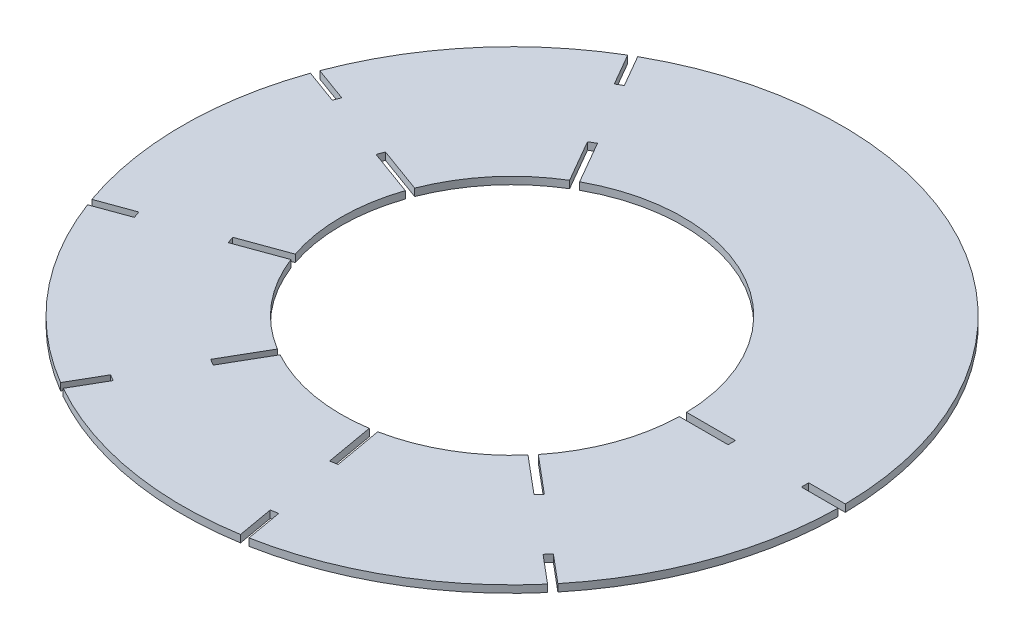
ISO-10303-21;
HEADER;
FILE_DESCRIPTION(('STEP AP214'),'2;1');
FILE_NAME('part.step','',(''),(''),'','','');
FILE_SCHEMA(('AUTOMOTIVE_DESIGN { 1 0 10303 214 1 1 1 1 }'));
ENDSEC;
DATA;
#1=APPLICATION_CONTEXT('core data for automotive mechanical design processes');
#2=APPLICATION_PROTOCOL_DEFINITION('international standard','automotive_design',2000,#1);
#3=PRODUCT_CONTEXT('',#1,'mechanical');
#4=PRODUCT('Part','Part','',(#3));
#5=PRODUCT_RELATED_PRODUCT_CATEGORY('part','',(#4));
#6=PRODUCT_DEFINITION_FORMATION('','',#4);
#7=PRODUCT_DEFINITION_CONTEXT('part definition',#1,'design');
#8=PRODUCT_DEFINITION('design','',#6,#7);
#9=PRODUCT_DEFINITION_SHAPE('','',#8);
#10=(LENGTH_UNIT() NAMED_UNIT(*) SI_UNIT(.MILLI.,.METRE.));
#11=(NAMED_UNIT(*) PLANE_ANGLE_UNIT() SI_UNIT($,.RADIAN.));
#12=(NAMED_UNIT(*) SI_UNIT($,.STERADIAN.) SOLID_ANGLE_UNIT());
#13=UNCERTAINTY_MEASURE_WITH_UNIT(LENGTH_MEASURE(1.E-05),#10,'distance_accuracy_value','');
#14=(GEOMETRIC_REPRESENTATION_CONTEXT(3) GLOBAL_UNCERTAINTY_ASSIGNED_CONTEXT((#13)) GLOBAL_UNIT_ASSIGNED_CONTEXT((#10,
#11,#12)) REPRESENTATION_CONTEXT('',''));
#15=CARTESIAN_POINT('',(0.,0.,0.));
#16=DIRECTION('',(0.,0.,1.));
#17=DIRECTION('',(1.,0.,0.));
#18=AXIS2_PLACEMENT_3D('',#15,#16,#17);
#19=CARTESIAN_POINT('',(0.,15.,0.));
#20=DIRECTION('',(0.,1.,0.));
#21=DIRECTION('',(0.,0.,1.));
#22=AXIS2_PLACEMENT_3D('',#19,#20,#21);
#23=PLANE('',#22);
#24=CARTESIAN_POINT('',(0.,15.,0.));
#25=DIRECTION('',(0.,1.,0.));
#26=DIRECTION('',(0.,0.,1.));
#27=AXIS2_PLACEMENT_3D('',#24,#25,#26);
#28=CIRCLE('',#27,350.);
#29=CARTESIAN_POINT('',(-181.455007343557,15.,-299.28929200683));
#30=VERTEX_POINT('',#29);
#31=CARTESIAN_POINT('',(-326.251746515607,15.,-126.727257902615));
#32=VERTEX_POINT('',#31);
#33=EDGE_CURVE('E774',#30,#32,#28,.T.);
#34=ORIENTED_EDGE('',*,*,#33,.F.);
#35=DIRECTION('',(-0.499999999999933,0.,-0.866025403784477));
#36=VECTOR('',#35,1.);
#37=CARTESIAN_POINT('',(-178.995190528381,15.,-295.028764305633));
#38=LINE('',#37,#36);
#39=CARTESIAN_POINT('',(-231.495190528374,15.,-385.961431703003));
#40=VERTEX_POINT('',#39);
#41=EDGE_CURVE('E512',#30,#40,#38,.T.);
#42=ORIENTED_EDGE('',*,*,#41,.T.);
#43=DIRECTION('',(0.866025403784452,0.,-0.499999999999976));
#44=VECTOR('',#43,1.);
#45=CARTESIAN_POINT('',(-231.495190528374,15.,-385.961431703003));
#46=LINE('',#45,#44);
#47=CARTESIAN_POINT('',(-218.504809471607,15.,-393.461431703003));
#48=VERTEX_POINT('',#47);
#49=EDGE_CURVE('E515',#40,#48,#46,.T.);
#50=ORIENTED_EDGE('',*,*,#49,.T.);
#51=DIRECTION('',(-0.499999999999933,0.,-0.866025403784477));
#52=VECTOR('',#51,1.);
#53=CARTESIAN_POINT('',(-166.004809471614,15.,-302.528764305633));
#54=LINE('',#53,#52);
#55=CARTESIAN_POINT('',(-168.46462628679,15.,-306.78929200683));
#56=VERTEX_POINT('',#55);
#57=EDGE_CURVE('E490',#56,#48,#54,.T.);
#58=ORIENTED_EDGE('',*,*,#57,.F.);
#59=CARTESIAN_POINT('',(349.919633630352,15.,-7.50000000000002));
#60=VERTEX_POINT('',#59);
#61=EDGE_CURVE('E770',#60,#56,#28,.T.);
#62=ORIENTED_EDGE('',*,*,#61,.F.);
#63=DIRECTION('',(1.,0.,0.));
#64=VECTOR('',#63,1.);
#65=CARTESIAN_POINT('',(345.,15.,-7.50000000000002));
#66=LINE('',#65,#64);
#67=CARTESIAN_POINT('',(450.,15.,-7.5));
#68=VERTEX_POINT('',#67);
#69=EDGE_CURVE('E645',#60,#68,#66,.T.);
#70=ORIENTED_EDGE('',*,*,#69,.T.);
#71=DIRECTION('',(0.,0.,1.));
#72=VECTOR('',#71,1.);
#73=CARTESIAN_POINT('',(450.,15.,-7.5));
#74=LINE('',#73,#72);
#75=CARTESIAN_POINT('',(450.,15.,7.5));
#76=VERTEX_POINT('',#75);
#77=EDGE_CURVE('E648',#68,#76,#74,.T.);
#78=ORIENTED_EDGE('',*,*,#77,.T.);
#79=DIRECTION('',(1.,0.,0.));
#80=VECTOR('',#79,1.);
#81=CARTESIAN_POINT('',(345.,15.,7.49999999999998));
#82=LINE('',#81,#80);
#83=CARTESIAN_POINT('',(349.919633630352,15.,7.49999999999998));
#84=VERTEX_POINT('',#83);
#85=EDGE_CURVE('E590',#84,#76,#82,.T.);
#86=ORIENTED_EDGE('',*,*,#85,.F.);
#87=CARTESIAN_POINT('',(272.874897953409,15.,219.178671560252));
#88=VERTEX_POINT('',#87);
#89=EDGE_CURVE('E773',#88,#84,#28,.T.);
#90=ORIENTED_EDGE('',*,*,#89,.F.);
#91=DIRECTION('',(0.766044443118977,0.,0.64278760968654));
#92=VECTOR('',#91,1.);
#93=CARTESIAN_POINT('',(269.106239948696,15.,216.016392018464));
#94=LINE('',#93,#92);
#95=CARTESIAN_POINT('',(349.540906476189,15.,283.509091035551));
#96=VERTEX_POINT('',#95);
#97=EDGE_CURVE('E591',#88,#96,#94,.T.);
#98=ORIENTED_EDGE('',*,*,#97,.T.);
#99=DIRECTION('',(-0.642787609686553,0.,0.766044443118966));
#100=VECTOR('',#99,1.);
#101=CARTESIAN_POINT('',(349.540906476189,15.,283.509091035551));
#102=LINE('',#101,#100);
#103=CARTESIAN_POINT('',(339.899092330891,15.,294.999757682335));
#104=VERTEX_POINT('',#103);
#105=EDGE_CURVE('E594',#96,#104,#102,.T.);
#106=ORIENTED_EDGE('',*,*,#105,.T.);
#107=DIRECTION('',(0.766044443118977,0.,0.642787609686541));
#108=VECTOR('',#107,1.);
#109=CARTESIAN_POINT('',(259.464425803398,15.,227.507058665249));
#110=LINE('',#109,#108);
#111=CARTESIAN_POINT('',(263.233083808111,15.,230.669338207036));
#112=VERTEX_POINT('',#111);
#113=EDGE_CURVE('E570',#112,#104,#110,.T.);
#114=ORIENTED_EDGE('',*,*,#113,.F.);
#115=CARTESIAN_POINT('',(68.1489648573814,15.,343.301206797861));
#116=VERTEX_POINT('',#115);
#117=EDGE_CURVE('E776',#116,#112,#28,.T.);
#118=ORIENTED_EDGE('',*,*,#117,.F.);
#119=DIRECTION('',(0.173648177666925,0.,0.984807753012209));
#120=VECTOR('',#119,1.);
#121=CARTESIAN_POINT('',(67.2946794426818,15.,338.45631345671));
#122=LINE('',#121,#120);
#123=CARTESIAN_POINT('',(85.5277380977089,15.,441.861127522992));
#124=VERTEX_POINT('',#123);
#125=EDGE_CURVE('E571',#116,#124,#122,.T.);
#126=ORIENTED_EDGE('',*,*,#125,.T.);
#127=DIRECTION('',(-0.984807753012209,0.,0.173648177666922));
#128=VECTOR('',#127,1.);
#129=CARTESIAN_POINT('',(85.5277380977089,15.,441.861127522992));
#130=LINE('',#129,#128);
#131=CARTESIAN_POINT('',(70.7556218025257,15.,444.465850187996));
#132=VERTEX_POINT('',#131);
#133=EDGE_CURVE('E574',#124,#132,#130,.T.);
#134=ORIENTED_EDGE('',*,*,#133,.T.);
#135=DIRECTION('',(0.173648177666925,0.,0.984807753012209));
#136=VECTOR('',#135,1.);
#137=CARTESIAN_POINT('',(52.5225631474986,15.,341.061036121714));
#138=LINE('',#137,#136);
#139=CARTESIAN_POINT('',(53.3768485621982,15.,345.905929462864));
#140=VERTEX_POINT('',#139);
#141=EDGE_CURVE('E548',#140,#132,#138,.T.);
#142=ORIENTED_EDGE('',*,*,#141,.F.);
#143=CARTESIAN_POINT('',(-168.464626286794,15.,306.789292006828));
#144=VERTEX_POINT('',#143);
#145=EDGE_CURVE('E682',#144,#140,#28,.T.);
#146=ORIENTED_EDGE('',*,*,#145,.F.);
#147=DIRECTION('',(-0.500000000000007,0.,0.866025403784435));
#148=VECTOR('',#147,1.);
#149=CARTESIAN_POINT('',(-166.004809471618,15.,302.528764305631));
#150=LINE('',#149,#148);
#151=CARTESIAN_POINT('',(-218.504809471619,15.,393.461431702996));
#152=VERTEX_POINT('',#151);
#153=EDGE_CURVE('E549',#144,#152,#150,.T.);
#154=ORIENTED_EDGE('',*,*,#153,.T.);
#155=DIRECTION('',(-0.866025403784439,0.,-0.5));
#156=VECTOR('',#155,1.);
#157=CARTESIAN_POINT('',(-218.504809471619,15.,393.461431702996));
#158=LINE('',#157,#156);
#159=CARTESIAN_POINT('',(-231.495190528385,15.,385.961431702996));
#160=VERTEX_POINT('',#159);
#161=EDGE_CURVE('E552',#152,#160,#158,.T.);
#162=ORIENTED_EDGE('',*,*,#161,.T.);
#163=DIRECTION('',(-0.500000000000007,0.,0.866025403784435));
#164=VECTOR('',#163,1.);
#165=CARTESIAN_POINT('',(-178.995190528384,15.,295.028764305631));
#166=LINE('',#165,#164);
#167=CARTESIAN_POINT('',(-181.455007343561,15.,299.289292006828));
#168=VERTEX_POINT('',#167);
#169=EDGE_CURVE('E556',#168,#160,#166,.T.);
#170=ORIENTED_EDGE('',*,*,#169,.F.);
#171=CARTESIAN_POINT('',(-326.251746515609,15.,126.727257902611));
#172=VERTEX_POINT('',#171);
#173=EDGE_CURVE('E678',#172,#168,#28,.T.);
#174=ORIENTED_EDGE('',*,*,#173,.F.);
#175=DIRECTION('',(-0.939692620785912,0.,0.342020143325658));
#176=VECTOR('',#175,1.);
#177=CARTESIAN_POINT('',(-321.628803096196,15.,125.044644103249));
#178=LINE('',#177,#176);
#179=CARTESIAN_POINT('',(-420.296528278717,15.,160.956759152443));
#180=VERTEX_POINT('',#179);
#181=EDGE_CURVE('E662',#172,#180,#178,.T.);
#182=ORIENTED_EDGE('',*,*,#181,.T.);
#183=DIRECTION('',(-0.342020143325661,0.,-0.939692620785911));
#184=VECTOR('',#183,1.);
#185=CARTESIAN_POINT('',(-420.296528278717,15.,160.956759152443));
#186=LINE('',#185,#184);
#187=CARTESIAN_POINT('',(-425.426830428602,15.,146.861369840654));
#188=VERTEX_POINT('',#187);
#189=EDGE_CURVE('E668',#180,#188,#186,.T.);
#190=ORIENTED_EDGE('',*,*,#189,.T.);
#191=DIRECTION('',(-0.939692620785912,0.,0.342020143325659));
#192=VECTOR('',#191,1.);
#193=CARTESIAN_POINT('',(-326.759105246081,15.,110.94925479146));
#194=LINE('',#193,#192);
#195=CARTESIAN_POINT('',(-331.382048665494,15.,112.631868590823));
#196=VERTEX_POINT('',#195);
#197=EDGE_CURVE('E558',#196,#188,#194,.T.);
#198=ORIENTED_EDGE('',*,*,#197,.F.);
#199=CARTESIAN_POINT('',(-331.382048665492,15.,-112.631868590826));
#200=VERTEX_POINT('',#199);
#201=EDGE_CURVE('E683',#200,#196,#28,.T.);
#202=ORIENTED_EDGE('',*,*,#201,.F.);
#203=DIRECTION('',(-0.939692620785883,0.,-0.342020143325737));
#204=VECTOR('',#203,1.);
#205=CARTESIAN_POINT('',(-326.75910524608,15.,-110.949254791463));
#206=LINE('',#205,#204);
#207=CARTESIAN_POINT('',(-425.426830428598,15.,-146.861369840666));
#208=VERTEX_POINT('',#207);
#209=EDGE_CURVE('E611',#200,#208,#206,.T.);
#210=ORIENTED_EDGE('',*,*,#209,.T.);
#211=DIRECTION('',(0.342020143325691,0.,-0.9396926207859));
#212=VECTOR('',#211,1.);
#213=CARTESIAN_POINT('',(-425.426830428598,15.,-146.861369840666));
#214=LINE('',#213,#212);
#215=CARTESIAN_POINT('',(-420.296528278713,15.,-160.956759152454));
#216=VERTEX_POINT('',#215);
#217=EDGE_CURVE('E614',#208,#216,#214,.T.);
#218=ORIENTED_EDGE('',*,*,#217,.T.);
#219=DIRECTION('',(-0.939692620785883,0.,-0.342020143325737));
#220=VECTOR('',#219,1.);
#221=CARTESIAN_POINT('',(-321.628803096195,15.,-125.044644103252));
#222=LINE('',#221,#220);
#223=EDGE_CURVE('E617',#32,#216,#222,.T.);
#224=ORIENTED_EDGE('',*,*,#223,.F.);
#225=EDGE_LOOP('',(#34,#42,#50,#58,#62,#70,#78,#86,#90,#98,#106,#114,#118,#126,#134,#142,#146,
#154,#162,#170,#174,#182,#190,#198,#202,#210,#218,#224));
#226=FACE_BOUND('',#225,.T.);
#227=DIRECTION('',(0.866025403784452,0.,-0.499999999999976));
#228=VECTOR('',#227,1.);
#229=CARTESIAN_POINT('',(-306.495190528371,15.,-515.86524227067));
#230=LINE('',#229,#228);
#231=CARTESIAN_POINT('',(-306.495190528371,15.,-515.86524227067));
#232=VERTEX_POINT('',#231);
#233=CARTESIAN_POINT('',(-293.504809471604,15.,-523.36524227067));
#234=VERTEX_POINT('',#233);
#235=EDGE_CURVE('E511',#232,#234,#230,.T.);
#236=ORIENTED_EDGE('',*,*,#235,.F.);
#237=DIRECTION('',(-0.499999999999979,0.,-0.866025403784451));
#238=VECTOR('',#237,1.);
#239=CARTESIAN_POINT('',(-306.495190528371,15.,-515.86524227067));
#240=LINE('',#239,#238);
#241=CARTESIAN_POINT('',(-343.974356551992,15.,-580.781062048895));
#242=VERTEX_POINT('',#241);
#243=EDGE_CURVE('E528',#232,#242,#240,.T.);
#244=ORIENTED_EDGE('',*,*,#243,.T.);
#245=CARTESIAN_POINT('',(0.,15.,0.));
#246=DIRECTION('',(0.,1.,0.));
#247=DIRECTION('',(0.,0.,1.));
#248=AXIS2_PLACEMENT_3D('',#245,#246,#247);
#249=CIRCLE('',#248,675.);
#250=CARTESIAN_POINT('',(-631.688212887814,15.,-237.897040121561));
#251=VERTEX_POINT('',#250);
#252=EDGE_CURVE('E1420',#242,#251,#249,.T.);
#253=ORIENTED_EDGE('',*,*,#252,.T.);
#254=DIRECTION('',(-0.939692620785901,0.,-0.342020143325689));
#255=VECTOR('',#254,1.);
#256=CARTESIAN_POINT('',(-561.250421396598,15.,-212.259780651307));
#257=LINE('',#256,#255);
#258=CARTESIAN_POINT('',(-561.250421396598,15.,-212.259780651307));
#259=VERTEX_POINT('',#258);
#260=EDGE_CURVE('E494',#259,#251,#257,.T.);
#261=ORIENTED_EDGE('',*,*,#260,.F.);
#262=DIRECTION('',(0.342020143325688,0.,-0.939692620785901));
#263=VECTOR('',#262,1.);
#264=CARTESIAN_POINT('',(-566.380723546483,15.,-198.164391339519));
#265=LINE('',#264,#263);
#266=CARTESIAN_POINT('',(-566.380723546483,15.,-198.164391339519));
#267=VERTEX_POINT('',#266);
#268=EDGE_CURVE('E470',#267,#259,#265,.T.);
#269=ORIENTED_EDGE('',*,*,#268,.F.);
#270=DIRECTION('',(-0.939692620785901,0.,-0.342020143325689));
#271=VECTOR('',#270,1.);
#272=CARTESIAN_POINT('',(-566.380723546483,15.,-198.164391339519));
#273=LINE('',#272,#271);
#274=CARTESIAN_POINT('',(-636.818515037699,15.,-223.801650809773));
#275=VERTEX_POINT('',#274);
#276=EDGE_CURVE('E491',#267,#275,#273,.T.);
#277=ORIENTED_EDGE('',*,*,#276,.T.);
#278=CARTESIAN_POINT('',(-636.818515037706,15.,223.801650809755));
#279=VERTEX_POINT('',#278);
#280=EDGE_CURVE('E1418',#275,#279,#249,.T.);
#281=ORIENTED_EDGE('',*,*,#280,.T.);
#282=DIRECTION('',(-0.93969262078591,0.,0.342020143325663));
#283=VECTOR('',#282,1.);
#284=CARTESIAN_POINT('',(-566.380723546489,15.,198.164391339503));
#285=LINE('',#284,#283);
#286=CARTESIAN_POINT('',(-566.380723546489,15.,198.164391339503));
#287=VERTEX_POINT('',#286);
#288=EDGE_CURVE('E474',#287,#279,#285,.T.);
#289=ORIENTED_EDGE('',*,*,#288,.F.);
#290=DIRECTION('',(-0.342020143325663,0.,-0.939692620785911));
#291=VECTOR('',#290,1.);
#292=CARTESIAN_POINT('',(-561.250421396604,15.,212.259780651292));
#293=LINE('',#292,#291);
#294=CARTESIAN_POINT('',(-561.250421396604,15.,212.259780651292));
#295=VERTEX_POINT('',#294);
#296=EDGE_CURVE('E450',#295,#287,#293,.T.);
#297=ORIENTED_EDGE('',*,*,#296,.F.);
#298=DIRECTION('',(-0.939692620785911,0.,0.342020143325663));
#299=VECTOR('',#298,1.);
#300=CARTESIAN_POINT('',(-561.250421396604,15.,212.259780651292));
#301=LINE('',#300,#299);
#302=CARTESIAN_POINT('',(-631.688212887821,15.,237.897040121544));
#303=VERTEX_POINT('',#302);
#304=EDGE_CURVE('E471',#295,#303,#301,.T.);
#305=ORIENTED_EDGE('',*,*,#304,.T.);
#306=CARTESIAN_POINT('',(-343.974356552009,15.,580.781062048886));
#307=VERTEX_POINT('',#306);
#308=EDGE_CURVE('E691',#303,#307,#249,.T.);
#309=ORIENTED_EDGE('',*,*,#308,.T.);
#310=DIRECTION('',(-0.500000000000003,0.,0.866025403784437));
#311=VECTOR('',#310,1.);
#312=CARTESIAN_POINT('',(-306.495190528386,15.,515.865242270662));
#313=LINE('',#312,#311);
#314=CARTESIAN_POINT('',(-306.495190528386,15.,515.865242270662));
#315=VERTEX_POINT('',#314);
#316=EDGE_CURVE('E454',#315,#307,#313,.T.);
#317=ORIENTED_EDGE('',*,*,#316,.F.);
#318=DIRECTION('',(-0.866025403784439,0.,-0.499999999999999));
#319=VECTOR('',#318,1.);
#320=CARTESIAN_POINT('',(-293.504809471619,15.,523.365242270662));
#321=LINE('',#320,#319);
#322=CARTESIAN_POINT('',(-293.504809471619,15.,523.365242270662));
#323=VERTEX_POINT('',#322);
#324=EDGE_CURVE('E430',#323,#315,#321,.T.);
#325=ORIENTED_EDGE('',*,*,#324,.F.);
#326=DIRECTION('',(-0.500000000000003,0.,0.866025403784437));
#327=VECTOR('',#326,1.);
#328=CARTESIAN_POINT('',(-293.504809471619,15.,523.365242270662));
#329=LINE('',#328,#327);
#330=CARTESIAN_POINT('',(-330.983975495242,15.,588.281062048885));
#331=VERTEX_POINT('',#330);
#332=EDGE_CURVE('E451',#323,#331,#329,.T.);
#333=ORIENTED_EDGE('',*,*,#332,.T.);
#334=CARTESIAN_POINT('',(109.819226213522,15.,666.006559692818));
#335=VERTEX_POINT('',#334);
#336=EDGE_CURVE('E688',#331,#335,#249,.T.);
#337=ORIENTED_EDGE('',*,*,#336,.T.);
#338=DIRECTION('',(0.173648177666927,0.,0.984807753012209));
#339=VECTOR('',#338,1.);
#340=CARTESIAN_POINT('',(96.8028484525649,15.,592.187013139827));
#341=LINE('',#340,#339);
#342=CARTESIAN_POINT('',(96.8028484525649,15.,592.187013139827));
#343=VERTEX_POINT('',#342);
#344=EDGE_CURVE('E434',#343,#335,#341,.T.);
#345=ORIENTED_EDGE('',*,*,#344,.F.);
#346=DIRECTION('',(-0.984807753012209,0.,0.173648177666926));
#347=VECTOR('',#346,1.);
#348=CARTESIAN_POINT('',(111.574964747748,15.,589.582290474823));
#349=LINE('',#348,#347);
#350=CARTESIAN_POINT('',(111.574964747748,15.,589.582290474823));
#351=VERTEX_POINT('',#350);
#352=EDGE_CURVE('E399',#351,#343,#349,.T.);
#353=ORIENTED_EDGE('',*,*,#352,.F.);
#354=DIRECTION('',(0.173648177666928,0.,0.984807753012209));
#355=VECTOR('',#354,1.);
#356=CARTESIAN_POINT('',(111.574964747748,15.,589.582290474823));
#357=LINE('',#356,#355);
#358=CARTESIAN_POINT('',(124.591342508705,15.,663.401837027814));
#359=VERTEX_POINT('',#358);
#360=EDGE_CURVE('E431',#351,#359,#357,.T.);
#361=ORIENTED_EDGE('',*,*,#360,.T.);
#362=CARTESIAN_POINT('',(512.227172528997,15.,439.600186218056));
#363=VERTEX_POINT('',#362);
#364=EDGE_CURVE('E693',#359,#363,#249,.T.);
#365=ORIENTED_EDGE('',*,*,#364,.T.);
#366=DIRECTION('',(0.766044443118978,0.,0.642787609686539));
#367=VECTOR('',#366,1.);
#368=CARTESIAN_POINT('',(454.805758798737,15.,391.417899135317));
#369=LINE('',#368,#367);
#370=CARTESIAN_POINT('',(454.805758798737,15.,391.417899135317));
#371=VERTEX_POINT('',#370);
#372=EDGE_CURVE('E409',#371,#363,#369,.T.);
#373=ORIENTED_EDGE('',*,*,#372,.F.);
#374=DIRECTION('',(-0.642787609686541,0.,0.766044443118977));
#375=VECTOR('',#374,1.);
#376=CARTESIAN_POINT('',(464.447572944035,15.,379.927232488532));
#377=LINE('',#376,#375);
#378=CARTESIAN_POINT('',(464.447572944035,15.,379.927232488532));
#379=VERTEX_POINT('',#378);
#380=EDGE_CURVE('E392',#379,#371,#377,.T.);
#381=ORIENTED_EDGE('',*,*,#380,.F.);
#382=DIRECTION('',(0.766044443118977,0.,0.64278760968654));
#383=VECTOR('',#382,1.);
#384=CARTESIAN_POINT('',(464.447572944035,15.,379.927232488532));
#385=LINE('',#384,#383);
#386=CARTESIAN_POINT('',(521.868986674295,15.,428.109519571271));
#387=VERTEX_POINT('',#386);
#388=EDGE_CURVE('E402',#379,#387,#385,.T.);
#389=ORIENTED_EDGE('',*,*,#388,.T.);
#390=CARTESIAN_POINT('',(674.958332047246,15.,7.5));
#391=VERTEX_POINT('',#390);
#392=EDGE_CURVE('E1427',#387,#391,#249,.T.);
#393=ORIENTED_EDGE('',*,*,#392,.T.);
#394=DIRECTION('',(1.,0.,0.));
#395=VECTOR('',#394,1.);
#396=CARTESIAN_POINT('',(600.,15.,7.5));
#397=LINE('',#396,#395);
#398=CARTESIAN_POINT('',(600.,15.,7.5));
#399=VERTEX_POINT('',#398);
#400=EDGE_CURVE('E629',#399,#391,#397,.T.);
#401=ORIENTED_EDGE('',*,*,#400,.F.);
#402=DIRECTION('',(0.,0.,1.));
#403=VECTOR('',#402,1.);
#404=CARTESIAN_POINT('',(600.,15.,-7.5));
#405=LINE('',#404,#403);
#406=CARTESIAN_POINT('',(600.,15.,-7.5));
#407=VERTEX_POINT('',#406);
#408=EDGE_CURVE('E610',#407,#399,#405,.T.);
#409=ORIENTED_EDGE('',*,*,#408,.F.);
#410=DIRECTION('',(1.,0.,0.));
#411=VECTOR('',#410,1.);
#412=CARTESIAN_POINT('',(600.,15.,-7.5));
#413=LINE('',#412,#411);
#414=CARTESIAN_POINT('',(674.958332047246,15.,-7.5));
#415=VERTEX_POINT('',#414);
#416=EDGE_CURVE('E626',#407,#415,#413,.T.);
#417=ORIENTED_EDGE('',*,*,#416,.T.);
#418=CARTESIAN_POINT('',(-330.983975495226,15.,-588.281062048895));
#419=VERTEX_POINT('',#418);
#420=EDGE_CURVE('E1424',#415,#419,#249,.T.);
#421=ORIENTED_EDGE('',*,*,#420,.T.);
#422=DIRECTION('',(-0.49999999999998,0.,-0.86602540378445));
#423=VECTOR('',#422,1.);
#424=CARTESIAN_POINT('',(-293.504809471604,15.,-523.36524227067));
#425=LINE('',#424,#423);
#426=EDGE_CURVE('E531',#234,#419,#425,.T.);
#427=ORIENTED_EDGE('',*,*,#426,.F.);
#428=EDGE_LOOP('',(#236,#244,#253,#261,#269,#277,#281,#289,#297,#305,#309,#317,#325,#333,#337,
#345,#353,#361,#365,#373,#381,#389,#393,#401,#409,#417,#421,#427));
#429=FACE_BOUND('',#428,.T.);
#430=ADVANCED_FACE('F33',(#226,#429),#23,.T.);
#431=CARTESIAN_POINT('',(0.,0.,0.));
#432=DIRECTION('',(0.,1.,0.));
#433=DIRECTION('',(0.,0.,1.));
#434=AXIS2_PLACEMENT_3D('',#431,#432,#433);
#435=PLANE('',#434);
#436=DIRECTION('',(-0.499999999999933,0.,-0.866025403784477));
#437=VECTOR('',#436,1.);
#438=CARTESIAN_POINT('',(-178.995190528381,0.,-295.028764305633));
#439=LINE('',#438,#437);
#440=CARTESIAN_POINT('',(-181.455007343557,0.,-299.28929200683));
#441=VERTEX_POINT('',#440);
#442=CARTESIAN_POINT('',(-231.495190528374,0.,-385.961431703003));
#443=VERTEX_POINT('',#442);
#444=EDGE_CURVE('E508',#441,#443,#439,.T.);
#445=ORIENTED_EDGE('',*,*,#444,.F.);
#446=CARTESIAN_POINT('',(0.,0.,0.));
#447=DIRECTION('',(0.,1.,0.));
#448=DIRECTION('',(0.,0.,1.));
#449=AXIS2_PLACEMENT_3D('',#446,#447,#448);
#450=CIRCLE('',#449,350.);
#451=CARTESIAN_POINT('',(-326.251746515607,0.,-126.727257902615));
#452=VERTEX_POINT('',#451);
#453=EDGE_CURVE('E802',#441,#452,#450,.T.);
#454=ORIENTED_EDGE('',*,*,#453,.T.);
#455=DIRECTION('',(-0.939692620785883,0.,-0.342020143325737));
#456=VECTOR('',#455,1.);
#457=CARTESIAN_POINT('',(-321.628803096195,0.,-125.044644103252));
#458=LINE('',#457,#456);
#459=CARTESIAN_POINT('',(-420.296528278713,0.,-160.956759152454));
#460=VERTEX_POINT('',#459);
#461=EDGE_CURVE('E48',#452,#460,#458,.T.);
#462=ORIENTED_EDGE('',*,*,#461,.T.);
#463=DIRECTION('',(0.342020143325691,0.,-0.9396926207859));
#464=VECTOR('',#463,1.);
#465=CARTESIAN_POINT('',(-425.426830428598,0.,-146.861369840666));
#466=LINE('',#465,#464);
#467=CARTESIAN_POINT('',(-425.426830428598,0.,-146.861369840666));
#468=VERTEX_POINT('',#467);
#469=EDGE_CURVE('E621',#468,#460,#466,.T.);
#470=ORIENTED_EDGE('',*,*,#469,.F.);
#471=DIRECTION('',(-0.939692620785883,0.,-0.342020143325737));
#472=VECTOR('',#471,1.);
#473=CARTESIAN_POINT('',(-326.75910524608,0.,-110.949254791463));
#474=LINE('',#473,#472);
#475=CARTESIAN_POINT('',(-331.382048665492,0.,-112.631868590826));
#476=VERTEX_POINT('',#475);
#477=EDGE_CURVE('E607',#476,#468,#474,.T.);
#478=ORIENTED_EDGE('',*,*,#477,.F.);
#479=CARTESIAN_POINT('',(-331.382048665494,0.,112.631868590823));
#480=VERTEX_POINT('',#479);
#481=EDGE_CURVE('E675',#476,#480,#450,.T.);
#482=ORIENTED_EDGE('',*,*,#481,.T.);
#483=DIRECTION('',(-0.939692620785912,0.,0.342020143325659));
#484=VECTOR('',#483,1.);
#485=CARTESIAN_POINT('',(-326.759105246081,0.,110.94925479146));
#486=LINE('',#485,#484);
#487=CARTESIAN_POINT('',(-425.426830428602,0.,146.861369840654));
#488=VERTEX_POINT('',#487);
#489=EDGE_CURVE('E658',#480,#488,#486,.T.);
#490=ORIENTED_EDGE('',*,*,#489,.T.);
#491=DIRECTION('',(-0.342020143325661,0.,-0.939692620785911));
#492=VECTOR('',#491,1.);
#493=CARTESIAN_POINT('',(-420.296528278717,0.,160.956759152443));
#494=LINE('',#493,#492);
#495=CARTESIAN_POINT('',(-420.296528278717,0.,160.956759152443));
#496=VERTEX_POINT('',#495);
#497=EDGE_CURVE('E661',#496,#488,#494,.T.);
#498=ORIENTED_EDGE('',*,*,#497,.F.);
#499=DIRECTION('',(-0.939692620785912,0.,0.342020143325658));
#500=VECTOR('',#499,1.);
#501=CARTESIAN_POINT('',(-321.628803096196,0.,125.044644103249));
#502=LINE('',#501,#500);
#503=CARTESIAN_POINT('',(-326.251746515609,0.,126.727257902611));
#504=VERTEX_POINT('',#503);
#505=EDGE_CURVE('E664',#504,#496,#502,.T.);
#506=ORIENTED_EDGE('',*,*,#505,.F.);
#507=CARTESIAN_POINT('',(-181.455007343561,0.,299.289292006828));
#508=VERTEX_POINT('',#507);
#509=EDGE_CURVE('E684',#504,#508,#450,.T.);
#510=ORIENTED_EDGE('',*,*,#509,.T.);
#511=DIRECTION('',(-0.500000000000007,0.,0.866025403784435));
#512=VECTOR('',#511,1.);
#513=CARTESIAN_POINT('',(-178.995190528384,0.,295.028764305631));
#514=LINE('',#513,#512);
#515=CARTESIAN_POINT('',(-231.495190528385,0.,385.961431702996));
#516=VERTEX_POINT('',#515);
#517=EDGE_CURVE('E553',#508,#516,#514,.T.);
#518=ORIENTED_EDGE('',*,*,#517,.T.);
#519=DIRECTION('',(-0.866025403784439,0.,-0.5));
#520=VECTOR('',#519,1.);
#521=CARTESIAN_POINT('',(-218.504809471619,0.,393.461431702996));
#522=LINE('',#521,#520);
#523=CARTESIAN_POINT('',(-218.504809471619,0.,393.461431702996));
#524=VERTEX_POINT('',#523);
#525=EDGE_CURVE('E560',#524,#516,#522,.T.);
#526=ORIENTED_EDGE('',*,*,#525,.F.);
#527=DIRECTION('',(-0.500000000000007,0.,0.866025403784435));
#528=VECTOR('',#527,1.);
#529=CARTESIAN_POINT('',(-166.004809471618,0.,302.528764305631));
#530=LINE('',#529,#528);
#531=CARTESIAN_POINT('',(-168.464626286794,0.,306.789292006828));
#532=VERTEX_POINT('',#531);
#533=EDGE_CURVE('E545',#532,#524,#530,.T.);
#534=ORIENTED_EDGE('',*,*,#533,.F.);
#535=CARTESIAN_POINT('',(53.3768485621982,0.,345.905929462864));
#536=VERTEX_POINT('',#535);
#537=EDGE_CURVE('E687',#532,#536,#450,.T.);
#538=ORIENTED_EDGE('',*,*,#537,.T.);
#539=DIRECTION('',(0.173648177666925,0.,0.984807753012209));
#540=VECTOR('',#539,1.);
#541=CARTESIAN_POINT('',(52.5225631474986,0.,341.061036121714));
#542=LINE('',#541,#540);
#543=CARTESIAN_POINT('',(70.7556218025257,0.,444.465850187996));
#544=VERTEX_POINT('',#543);
#545=EDGE_CURVE('E575',#536,#544,#542,.T.);
#546=ORIENTED_EDGE('',*,*,#545,.T.);
#547=DIRECTION('',(-0.984807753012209,0.,0.173648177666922));
#548=VECTOR('',#547,1.);
#549=CARTESIAN_POINT('',(85.5277380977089,0.,441.861127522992));
#550=LINE('',#549,#548);
#551=CARTESIAN_POINT('',(85.5277380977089,0.,441.861127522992));
#552=VERTEX_POINT('',#551);
#553=EDGE_CURVE('E580',#552,#544,#550,.T.);
#554=ORIENTED_EDGE('',*,*,#553,.F.);
#555=DIRECTION('',(0.173648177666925,0.,0.984807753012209));
#556=VECTOR('',#555,1.);
#557=CARTESIAN_POINT('',(67.2946794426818,0.,338.45631345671));
#558=LINE('',#557,#556);
#559=CARTESIAN_POINT('',(68.1489648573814,0.,343.301206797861));
#560=VERTEX_POINT('',#559);
#561=EDGE_CURVE('E567',#560,#552,#558,.T.);
#562=ORIENTED_EDGE('',*,*,#561,.F.);
#563=CARTESIAN_POINT('',(263.233083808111,0.,230.669338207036));
#564=VERTEX_POINT('',#563);
#565=EDGE_CURVE('E809',#560,#564,#450,.T.);
#566=ORIENTED_EDGE('',*,*,#565,.T.);
#567=DIRECTION('',(0.766044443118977,0.,0.642787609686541));
#568=VECTOR('',#567,1.);
#569=CARTESIAN_POINT('',(259.464425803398,0.,227.507058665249));
#570=LINE('',#569,#568);
#571=CARTESIAN_POINT('',(339.899092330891,0.,294.999757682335));
#572=VERTEX_POINT('',#571);
#573=EDGE_CURVE('E595',#564,#572,#570,.T.);
#574=ORIENTED_EDGE('',*,*,#573,.T.);
#575=DIRECTION('',(-0.642787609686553,0.,0.766044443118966));
#576=VECTOR('',#575,1.);
#577=CARTESIAN_POINT('',(349.540906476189,0.,283.509091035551));
#578=LINE('',#577,#576);
#579=CARTESIAN_POINT('',(349.540906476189,0.,283.509091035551));
#580=VERTEX_POINT('',#579);
#581=EDGE_CURVE('E600',#580,#572,#578,.T.);
#582=ORIENTED_EDGE('',*,*,#581,.F.);
#583=DIRECTION('',(0.766044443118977,0.,0.64278760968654));
#584=VECTOR('',#583,1.);
#585=CARTESIAN_POINT('',(269.106239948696,0.,216.016392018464));
#586=LINE('',#585,#584);
#587=CARTESIAN_POINT('',(272.874897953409,0.,219.178671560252));
#588=VERTEX_POINT('',#587);
#589=EDGE_CURVE('E587',#588,#580,#586,.T.);
#590=ORIENTED_EDGE('',*,*,#589,.F.);
#591=CARTESIAN_POINT('',(349.919633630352,0.,7.49999999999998));
#592=VERTEX_POINT('',#591);
#593=EDGE_CURVE('E806',#588,#592,#450,.T.);
#594=ORIENTED_EDGE('',*,*,#593,.T.);
#595=DIRECTION('',(1.,0.,0.));
#596=VECTOR('',#595,1.);
#597=CARTESIAN_POINT('',(345.,0.,7.49999999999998));
#598=LINE('',#597,#596);
#599=CARTESIAN_POINT('',(450.,0.,7.5));
#600=VERTEX_POINT('',#599);
#601=EDGE_CURVE('E649',#592,#600,#598,.T.);
#602=ORIENTED_EDGE('',*,*,#601,.T.);
#603=DIRECTION('',(0.,0.,1.));
#604=VECTOR('',#603,1.);
#605=CARTESIAN_POINT('',(450.,0.,-7.5));
#606=LINE('',#605,#604);
#607=CARTESIAN_POINT('',(450.,0.,-7.5));
#608=VERTEX_POINT('',#607);
#609=EDGE_CURVE('E654',#608,#600,#606,.T.);
#610=ORIENTED_EDGE('',*,*,#609,.F.);
#611=DIRECTION('',(1.,0.,0.));
#612=VECTOR('',#611,1.);
#613=CARTESIAN_POINT('',(345.,0.,-7.50000000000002));
#614=LINE('',#613,#612);
#615=CARTESIAN_POINT('',(349.919633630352,0.,-7.50000000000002));
#616=VERTEX_POINT('',#615);
#617=EDGE_CURVE('E643',#616,#608,#614,.T.);
#618=ORIENTED_EDGE('',*,*,#617,.F.);
#619=CARTESIAN_POINT('',(-168.46462628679,0.,-306.78929200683));
#620=VERTEX_POINT('',#619);
#621=EDGE_CURVE('E804',#616,#620,#450,.T.);
#622=ORIENTED_EDGE('',*,*,#621,.T.);
#623=DIRECTION('',(-0.499999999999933,0.,-0.866025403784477));
#624=VECTOR('',#623,1.);
#625=CARTESIAN_POINT('',(-166.004809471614,0.,-302.528764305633));
#626=LINE('',#625,#624);
#627=CARTESIAN_POINT('',(-218.504809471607,0.,-393.461431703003));
#628=VERTEX_POINT('',#627);
#629=EDGE_CURVE('E56',#620,#628,#626,.T.);
#630=ORIENTED_EDGE('',*,*,#629,.T.);
#631=DIRECTION('',(0.866025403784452,0.,-0.499999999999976));
#632=VECTOR('',#631,1.);
#633=CARTESIAN_POINT('',(-231.495190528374,0.,-385.961431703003));
#634=LINE('',#633,#632);
#635=EDGE_CURVE('E520',#443,#628,#634,.T.);
#636=ORIENTED_EDGE('',*,*,#635,.F.);
#637=EDGE_LOOP('',(#445,#454,#462,#470,#478,#482,#490,#498,#506,#510,#518,#526,#534,#538,#546,
#554,#562,#566,#574,#582,#590,#594,#602,#610,#618,#622,#630,#636));
#638=FACE_BOUND('',#637,.T.);
#639=DIRECTION('',(-0.499999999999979,0.,-0.866025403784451));
#640=VECTOR('',#639,1.);
#641=CARTESIAN_POINT('',(-306.495190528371,0.,-515.86524227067));
#642=LINE('',#641,#640);
#643=CARTESIAN_POINT('',(-306.495190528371,0.,-515.86524227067));
#644=VERTEX_POINT('',#643);
#645=CARTESIAN_POINT('',(-343.974356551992,0.,-580.781062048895));
#646=VERTEX_POINT('',#645);
#647=EDGE_CURVE('E525',#644,#646,#642,.T.);
#648=ORIENTED_EDGE('',*,*,#647,.F.);
#649=DIRECTION('',(0.866025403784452,0.,-0.499999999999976));
#650=VECTOR('',#649,1.);
#651=CARTESIAN_POINT('',(-306.495190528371,0.,-515.86524227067));
#652=LINE('',#651,#650);
#653=CARTESIAN_POINT('',(-293.504809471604,0.,-523.36524227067));
#654=VERTEX_POINT('',#653);
#655=EDGE_CURVE('E532',#644,#654,#652,.T.);
#656=ORIENTED_EDGE('',*,*,#655,.T.);
#657=DIRECTION('',(-0.49999999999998,0.,-0.86602540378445));
#658=VECTOR('',#657,1.);
#659=CARTESIAN_POINT('',(-293.504809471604,0.,-523.36524227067));
#660=LINE('',#659,#658);
#661=CARTESIAN_POINT('',(-330.983975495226,0.,-588.281062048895));
#662=VERTEX_POINT('',#661);
#663=EDGE_CURVE('E537',#654,#662,#660,.T.);
#664=ORIENTED_EDGE('',*,*,#663,.T.);
#665=CARTESIAN_POINT('',(0.,0.,0.));
#666=DIRECTION('',(0.,1.,0.));
#667=DIRECTION('',(0.,0.,1.));
#668=AXIS2_PLACEMENT_3D('',#665,#666,#667);
#669=CIRCLE('',#668,675.);
#670=CARTESIAN_POINT('',(674.958332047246,0.,-7.5));
#671=VERTEX_POINT('',#670);
#672=EDGE_CURVE('E1390',#671,#662,#669,.T.);
#673=ORIENTED_EDGE('',*,*,#672,.F.);
#674=DIRECTION('',(1.,0.,0.));
#675=VECTOR('',#674,1.);
#676=CARTESIAN_POINT('',(600.,0.,-7.5));
#677=LINE('',#676,#675);
#678=CARTESIAN_POINT('',(600.,0.,-7.5));
#679=VERTEX_POINT('',#678);
#680=EDGE_CURVE('E624',#679,#671,#677,.T.);
#681=ORIENTED_EDGE('',*,*,#680,.F.);
#682=DIRECTION('',(0.,0.,1.));
#683=VECTOR('',#682,1.);
#684=CARTESIAN_POINT('',(600.,0.,-7.5));
#685=LINE('',#684,#683);
#686=CARTESIAN_POINT('',(600.,0.,7.5));
#687=VERTEX_POINT('',#686);
#688=EDGE_CURVE('E630',#679,#687,#685,.T.);
#689=ORIENTED_EDGE('',*,*,#688,.T.);
#690=DIRECTION('',(1.,0.,0.));
#691=VECTOR('',#690,1.);
#692=CARTESIAN_POINT('',(600.,0.,7.5));
#693=LINE('',#692,#691);
#694=CARTESIAN_POINT('',(674.958332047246,0.,7.5));
#695=VERTEX_POINT('',#694);
#696=EDGE_CURVE('E635',#687,#695,#693,.T.);
#697=ORIENTED_EDGE('',*,*,#696,.T.);
#698=CARTESIAN_POINT('',(521.868986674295,0.,428.109519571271));
#699=VERTEX_POINT('',#698);
#700=EDGE_CURVE('E1394',#699,#695,#669,.T.);
#701=ORIENTED_EDGE('',*,*,#700,.F.);
#702=DIRECTION('',(0.766044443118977,0.,0.64278760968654));
#703=VECTOR('',#702,1.);
#704=CARTESIAN_POINT('',(464.447572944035,0.,379.927232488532));
#705=LINE('',#704,#703);
#706=CARTESIAN_POINT('',(464.447572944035,0.,379.927232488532));
#707=VERTEX_POINT('',#706);
#708=EDGE_CURVE('E419',#707,#699,#705,.T.);
#709=ORIENTED_EDGE('',*,*,#708,.F.);
#710=DIRECTION('',(-0.642787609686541,0.,0.766044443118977));
#711=VECTOR('',#710,1.);
#712=CARTESIAN_POINT('',(464.447572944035,0.,379.927232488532));
#713=LINE('',#712,#711);
#714=CARTESIAN_POINT('',(454.805758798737,0.,391.417899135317));
#715=VERTEX_POINT('',#714);
#716=EDGE_CURVE('E395',#707,#715,#713,.T.);
#717=ORIENTED_EDGE('',*,*,#716,.T.);
#718=DIRECTION('',(0.766044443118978,0.,0.642787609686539));
#719=VECTOR('',#718,1.);
#720=CARTESIAN_POINT('',(454.805758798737,0.,391.417899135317));
#721=LINE('',#720,#719);
#722=CARTESIAN_POINT('',(512.227172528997,0.,439.600186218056));
#723=VERTEX_POINT('',#722);
#724=EDGE_CURVE('E421',#715,#723,#721,.T.);
#725=ORIENTED_EDGE('',*,*,#724,.T.);
#726=CARTESIAN_POINT('',(124.591342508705,0.,663.401837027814));
#727=VERTEX_POINT('',#726);
#728=EDGE_CURVE('E692',#727,#723,#669,.T.);
#729=ORIENTED_EDGE('',*,*,#728,.F.);
#730=DIRECTION('',(0.173648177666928,0.,0.984807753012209));
#731=VECTOR('',#730,1.);
#732=CARTESIAN_POINT('',(111.574964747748,0.,589.582290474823));
#733=LINE('',#732,#731);
#734=CARTESIAN_POINT('',(111.574964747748,0.,589.582290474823));
#735=VERTEX_POINT('',#734);
#736=EDGE_CURVE('E427',#735,#727,#733,.T.);
#737=ORIENTED_EDGE('',*,*,#736,.F.);
#738=DIRECTION('',(-0.984807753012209,0.,0.173648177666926));
#739=VECTOR('',#738,1.);
#740=CARTESIAN_POINT('',(111.574964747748,0.,589.582290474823));
#741=LINE('',#740,#739);
#742=CARTESIAN_POINT('',(96.8028484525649,0.,592.187013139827));
#743=VERTEX_POINT('',#742);
#744=EDGE_CURVE('E435',#735,#743,#741,.T.);
#745=ORIENTED_EDGE('',*,*,#744,.T.);
#746=DIRECTION('',(0.173648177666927,0.,0.984807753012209));
#747=VECTOR('',#746,1.);
#748=CARTESIAN_POINT('',(96.8028484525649,0.,592.187013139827));
#749=LINE('',#748,#747);
#750=CARTESIAN_POINT('',(109.819226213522,0.,666.006559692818));
#751=VERTEX_POINT('',#750);
#752=EDGE_CURVE('E440',#743,#751,#749,.T.);
#753=ORIENTED_EDGE('',*,*,#752,.T.);
#754=CARTESIAN_POINT('',(-330.983975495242,0.,588.281062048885));
#755=VERTEX_POINT('',#754);
#756=EDGE_CURVE('E681',#755,#751,#669,.T.);
#757=ORIENTED_EDGE('',*,*,#756,.F.);
#758=DIRECTION('',(-0.500000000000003,0.,0.866025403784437));
#759=VECTOR('',#758,1.);
#760=CARTESIAN_POINT('',(-293.504809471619,0.,523.365242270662));
#761=LINE('',#760,#759);
#762=CARTESIAN_POINT('',(-293.504809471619,0.,523.365242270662));
#763=VERTEX_POINT('',#762);
#764=EDGE_CURVE('E447',#763,#755,#761,.T.);
#765=ORIENTED_EDGE('',*,*,#764,.F.);
#766=DIRECTION('',(-0.866025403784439,0.,-0.499999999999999));
#767=VECTOR('',#766,1.);
#768=CARTESIAN_POINT('',(-293.504809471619,0.,523.365242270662));
#769=LINE('',#768,#767);
#770=CARTESIAN_POINT('',(-306.495190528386,0.,515.865242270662));
#771=VERTEX_POINT('',#770);
#772=EDGE_CURVE('E455',#763,#771,#769,.T.);
#773=ORIENTED_EDGE('',*,*,#772,.T.);
#774=DIRECTION('',(-0.500000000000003,0.,0.866025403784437));
#775=VECTOR('',#774,1.);
#776=CARTESIAN_POINT('',(-306.495190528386,0.,515.865242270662));
#777=LINE('',#776,#775);
#778=CARTESIAN_POINT('',(-343.974356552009,0.,580.781062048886));
#779=VERTEX_POINT('',#778);
#780=EDGE_CURVE('E460',#771,#779,#777,.T.);
#781=ORIENTED_EDGE('',*,*,#780,.T.);
#782=CARTESIAN_POINT('',(-631.688212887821,0.,237.897040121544));
#783=VERTEX_POINT('',#782);
#784=EDGE_CURVE('E696',#783,#779,#669,.T.);
#785=ORIENTED_EDGE('',*,*,#784,.F.);
#786=DIRECTION('',(-0.939692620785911,0.,0.342020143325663));
#787=VECTOR('',#786,1.);
#788=CARTESIAN_POINT('',(-561.250421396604,0.,212.259780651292));
#789=LINE('',#788,#787);
#790=CARTESIAN_POINT('',(-561.250421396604,0.,212.259780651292));
#791=VERTEX_POINT('',#790);
#792=EDGE_CURVE('E467',#791,#783,#789,.T.);
#793=ORIENTED_EDGE('',*,*,#792,.F.);
#794=DIRECTION('',(-0.342020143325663,0.,-0.939692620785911));
#795=VECTOR('',#794,1.);
#796=CARTESIAN_POINT('',(-561.250421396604,0.,212.259780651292));
#797=LINE('',#796,#795);
#798=CARTESIAN_POINT('',(-566.380723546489,0.,198.164391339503));
#799=VERTEX_POINT('',#798);
#800=EDGE_CURVE('E475',#791,#799,#797,.T.);
#801=ORIENTED_EDGE('',*,*,#800,.T.);
#802=DIRECTION('',(-0.93969262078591,0.,0.342020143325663));
#803=VECTOR('',#802,1.);
#804=CARTESIAN_POINT('',(-566.380723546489,0.,198.164391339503));
#805=LINE('',#804,#803);
#806=CARTESIAN_POINT('',(-636.818515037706,0.,223.801650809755));
#807=VERTEX_POINT('',#806);
#808=EDGE_CURVE('E480',#799,#807,#805,.T.);
#809=ORIENTED_EDGE('',*,*,#808,.T.);
#810=CARTESIAN_POINT('',(-636.818515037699,0.,-223.801650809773));
#811=VERTEX_POINT('',#810);
#812=EDGE_CURVE('E1398',#811,#807,#669,.T.);
#813=ORIENTED_EDGE('',*,*,#812,.F.);
#814=DIRECTION('',(-0.939692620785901,0.,-0.342020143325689));
#815=VECTOR('',#814,1.);
#816=CARTESIAN_POINT('',(-566.380723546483,0.,-198.164391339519));
#817=LINE('',#816,#815);
#818=CARTESIAN_POINT('',(-566.380723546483,0.,-198.164391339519));
#819=VERTEX_POINT('',#818);
#820=EDGE_CURVE('E487',#819,#811,#817,.T.);
#821=ORIENTED_EDGE('',*,*,#820,.F.);
#822=DIRECTION('',(0.342020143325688,0.,-0.939692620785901));
#823=VECTOR('',#822,1.);
#824=CARTESIAN_POINT('',(-566.380723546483,0.,-198.164391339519));
#825=LINE('',#824,#823);
#826=CARTESIAN_POINT('',(-561.250421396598,0.,-212.259780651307));
#827=VERTEX_POINT('',#826);
#828=EDGE_CURVE('E495',#819,#827,#825,.T.);
#829=ORIENTED_EDGE('',*,*,#828,.T.);
#830=DIRECTION('',(-0.939692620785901,0.,-0.342020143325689));
#831=VECTOR('',#830,1.);
#832=CARTESIAN_POINT('',(-561.250421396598,0.,-212.259780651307));
#833=LINE('',#832,#831);
#834=CARTESIAN_POINT('',(-631.688212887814,0.,-237.897040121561));
#835=VERTEX_POINT('',#834);
#836=EDGE_CURVE('E500',#827,#835,#833,.T.);
#837=ORIENTED_EDGE('',*,*,#836,.T.);
#838=EDGE_CURVE('E1395',#646,#835,#669,.T.);
#839=ORIENTED_EDGE('',*,*,#838,.F.);
#840=EDGE_LOOP('',(#648,#656,#664,#673,#681,#689,#697,#701,#709,#717,#725,#729,#737,#745,#753,
#757,#765,#773,#781,#785,#793,#801,#809,#813,#821,#829,#837,#839));
#841=FACE_BOUND('',#840,.T.);
#842=ADVANCED_FACE('F797',(#638,#841),#435,.F.);
#843=CARTESIAN_POINT('',(0.,15.,0.));
#844=DIRECTION('',(0.,-1.,0.));
#845=DIRECTION('',(0.,0.,-1.));
#846=AXIS2_PLACEMENT_3D('',#843,#844,#845);
#847=CYLINDRICAL_SURFACE('',#846,350.);
#848=ORIENTED_EDGE('',*,*,#453,.F.);
#849=DIRECTION('',(0.,-1.,0.));
#850=VECTOR('',#849,1.);
#851=CARTESIAN_POINT('',(-181.455007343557,15.,-299.28929200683));
#852=LINE('',#851,#850);
#853=EDGE_CURVE('E11',#441,#30,#852,.F.);
#854=ORIENTED_EDGE('',*,*,#853,.T.);
#855=ORIENTED_EDGE('',*,*,#33,.T.);
#856=DIRECTION('',(0.,-1.,0.));
#857=VECTOR('',#856,1.);
#858=CARTESIAN_POINT('',(-326.251746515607,15.,-126.727257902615));
#859=LINE('',#858,#857);
#860=EDGE_CURVE('E752',#452,#32,#859,.F.);
#861=ORIENTED_EDGE('',*,*,#860,.F.);
#862=EDGE_LOOP('',(#848,#854,#855,#861));
#863=FACE_BOUND('',#862,.T.);
#864=ADVANCED_FACE('F880',(#863),#847,.F.);
#865=DIRECTION('',(0.,-1.,0.));
#866=VECTOR('',#865,1.);
#867=CARTESIAN_POINT('',(-168.46462628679,15.,-306.78929200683));
#868=LINE('',#867,#866);
#869=EDGE_CURVE('E41',#620,#56,#868,.F.);
#870=ORIENTED_EDGE('',*,*,#869,.F.);
#871=ORIENTED_EDGE('',*,*,#621,.F.);
#872=DIRECTION('',(0.,-1.,0.));
#873=VECTOR('',#872,1.);
#874=CARTESIAN_POINT('',(349.919633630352,15.,-7.50000000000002));
#875=LINE('',#874,#873);
#876=EDGE_CURVE('E759',#616,#60,#875,.F.);
#877=ORIENTED_EDGE('',*,*,#876,.T.);
#878=ORIENTED_EDGE('',*,*,#61,.T.);
#879=EDGE_LOOP('',(#870,#871,#877,#878));
#880=FACE_BOUND('',#879,.T.);
#881=ADVANCED_FACE('F772',(#880),#847,.F.);
#882=ORIENTED_EDGE('',*,*,#481,.F.);
#883=DIRECTION('',(0.,-1.,0.));
#884=VECTOR('',#883,1.);
#885=CARTESIAN_POINT('',(-331.382048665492,15.,-112.631868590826));
#886=LINE('',#885,#884);
#887=EDGE_CURVE('E754',#476,#200,#886,.F.);
#888=ORIENTED_EDGE('',*,*,#887,.T.);
#889=ORIENTED_EDGE('',*,*,#201,.T.);
#890=DIRECTION('',(0.,-1.,0.));
#891=VECTOR('',#890,1.);
#892=CARTESIAN_POINT('',(-331.382048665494,15.,112.631868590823));
#893=LINE('',#892,#891);
#894=EDGE_CURVE('E697',#480,#196,#893,.F.);
#895=ORIENTED_EDGE('',*,*,#894,.F.);
#896=EDGE_LOOP('',(#882,#888,#889,#895));
#897=FACE_BOUND('',#896,.T.);
#898=ADVANCED_FACE('F783',(#897),#847,.F.);
#899=DIRECTION('',(0.,-1.,0.));
#900=VECTOR('',#899,1.);
#901=CARTESIAN_POINT('',(349.919633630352,15.,7.49999999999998));
#902=LINE('',#901,#900);
#903=EDGE_CURVE('E757',#592,#84,#902,.F.);
#904=ORIENTED_EDGE('',*,*,#903,.F.);
#905=ORIENTED_EDGE('',*,*,#593,.F.);
#906=DIRECTION('',(0.,-1.,0.));
#907=VECTOR('',#906,1.);
#908=CARTESIAN_POINT('',(272.874897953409,15.,219.178671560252));
#909=LINE('',#908,#907);
#910=EDGE_CURVE('E749',#588,#88,#909,.F.);
#911=ORIENTED_EDGE('',*,*,#910,.T.);
#912=ORIENTED_EDGE('',*,*,#89,.T.);
#913=EDGE_LOOP('',(#904,#905,#911,#912));
#914=FACE_BOUND('',#913,.T.);
#915=ADVANCED_FACE('F852',(#914),#847,.F.);
#916=DIRECTION('',(0.,-1.,0.));
#917=VECTOR('',#916,1.);
#918=CARTESIAN_POINT('',(263.233083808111,15.,230.669338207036));
#919=LINE('',#918,#917);
#920=EDGE_CURVE('E747',#564,#112,#919,.F.);
#921=ORIENTED_EDGE('',*,*,#920,.F.);
#922=ORIENTED_EDGE('',*,*,#565,.F.);
#923=DIRECTION('',(0.,-1.,0.));
#924=VECTOR('',#923,1.);
#925=CARTESIAN_POINT('',(68.1489648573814,15.,343.30120679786));
#926=LINE('',#925,#924);
#927=EDGE_CURVE('E744',#560,#116,#926,.F.);
#928=ORIENTED_EDGE('',*,*,#927,.T.);
#929=ORIENTED_EDGE('',*,*,#117,.T.);
#930=EDGE_LOOP('',(#921,#922,#928,#929));
#931=FACE_BOUND('',#930,.T.);
#932=ADVANCED_FACE('F837',(#931),#847,.F.);
#933=DIRECTION('',(0.,-1.,0.));
#934=VECTOR('',#933,1.);
#935=CARTESIAN_POINT('',(53.3768485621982,15.,345.905929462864));
#936=LINE('',#935,#934);
#937=EDGE_CURVE('E742',#536,#140,#936,.F.);
#938=ORIENTED_EDGE('',*,*,#937,.F.);
#939=ORIENTED_EDGE('',*,*,#537,.F.);
#940=DIRECTION('',(0.,-1.,0.));
#941=VECTOR('',#940,1.);
#942=CARTESIAN_POINT('',(-168.464626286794,15.,306.789292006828));
#943=LINE('',#942,#941);
#944=EDGE_CURVE('E739',#532,#144,#943,.F.);
#945=ORIENTED_EDGE('',*,*,#944,.T.);
#946=ORIENTED_EDGE('',*,*,#145,.T.);
#947=EDGE_LOOP('',(#938,#939,#945,#946));
#948=FACE_BOUND('',#947,.T.);
#949=ADVANCED_FACE('F822',(#948),#847,.F.);
#950=CARTESIAN_POINT('',(0.,15.,0.));
#951=DIRECTION('',(0.,-1.,0.));
#952=DIRECTION('',(0.,0.,-1.));
#953=AXIS2_PLACEMENT_3D('',#950,#951,#952);
#954=CYLINDRICAL_SURFACE('',#953,675.);
#955=DIRECTION('',(0.,-1.,0.));
#956=VECTOR('',#955,1.);
#957=CARTESIAN_POINT('',(-343.974356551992,15.,-580.781062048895));
#958=LINE('',#957,#956);
#959=EDGE_CURVE('E735',#646,#242,#958,.F.);
#960=ORIENTED_EDGE('',*,*,#959,.F.);
#961=ORIENTED_EDGE('',*,*,#838,.T.);
#962=DIRECTION('',(0.,-1.,0.));
#963=VECTOR('',#962,1.);
#964=CARTESIAN_POINT('',(-631.688212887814,15.,-237.897040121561));
#965=LINE('',#964,#963);
#966=EDGE_CURVE('E727',#835,#251,#965,.F.);
#967=ORIENTED_EDGE('',*,*,#966,.T.);
#968=ORIENTED_EDGE('',*,*,#252,.F.);
#969=EDGE_LOOP('',(#960,#961,#967,#968));
#970=FACE_BOUND('',#969,.T.);
#971=ADVANCED_FACE('F35',(#970),#954,.T.);
#972=DIRECTION('',(0.,-1.,0.));
#973=VECTOR('',#972,1.);
#974=CARTESIAN_POINT('',(-636.8185150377,15.,-223.801650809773));
#975=LINE('',#974,#973);
#976=EDGE_CURVE('E730',#811,#275,#975,.F.);
#977=ORIENTED_EDGE('',*,*,#976,.F.);
#978=ORIENTED_EDGE('',*,*,#812,.T.);
#979=DIRECTION('',(0.,-1.,0.));
#980=VECTOR('',#979,1.);
#981=CARTESIAN_POINT('',(-636.818515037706,15.,223.801650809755));
#982=LINE('',#981,#980);
#983=EDGE_CURVE('E722',#807,#279,#982,.F.);
#984=ORIENTED_EDGE('',*,*,#983,.T.);
#985=ORIENTED_EDGE('',*,*,#280,.F.);
#986=EDGE_LOOP('',(#977,#978,#984,#985));
#987=FACE_BOUND('',#986,.T.);
#988=ADVANCED_FACE('F1320',(#987),#954,.T.);
#989=DIRECTION('',(0.,-1.,0.));
#990=VECTOR('',#989,1.);
#991=CARTESIAN_POINT('',(-631.688212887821,15.,237.897040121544));
#992=LINE('',#991,#990);
#993=EDGE_CURVE('E725',#783,#303,#992,.F.);
#994=ORIENTED_EDGE('',*,*,#993,.F.);
#995=ORIENTED_EDGE('',*,*,#784,.T.);
#996=DIRECTION('',(0.,-1.,0.));
#997=VECTOR('',#996,1.);
#998=CARTESIAN_POINT('',(-343.974356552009,15.,580.781062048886));
#999=LINE('',#998,#997);
#1000=EDGE_CURVE('E717',#779,#307,#999,.F.);
#1001=ORIENTED_EDGE('',*,*,#1000,.T.);
#1002=ORIENTED_EDGE('',*,*,#308,.F.);
#1003=EDGE_LOOP('',(#994,#995,#1001,#1002));
#1004=FACE_BOUND('',#1003,.T.);
#1005=ADVANCED_FACE('F1328',(#1004),#954,.T.);
#1006=DIRECTION('',(0.,-1.,0.));
#1007=VECTOR('',#1006,1.);
#1008=CARTESIAN_POINT('',(-330.983975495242,15.,588.281062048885));
#1009=LINE('',#1008,#1007);
#1010=EDGE_CURVE('E720',#755,#331,#1009,.F.);
#1011=ORIENTED_EDGE('',*,*,#1010,.F.);
#1012=ORIENTED_EDGE('',*,*,#756,.T.);
#1013=DIRECTION('',(0.,-1.,0.));
#1014=VECTOR('',#1013,1.);
#1015=CARTESIAN_POINT('',(109.819226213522,15.,666.006559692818));
#1016=LINE('',#1015,#1014);
#1017=EDGE_CURVE('E712',#751,#335,#1016,.F.);
#1018=ORIENTED_EDGE('',*,*,#1017,.T.);
#1019=ORIENTED_EDGE('',*,*,#336,.F.);
#1020=EDGE_LOOP('',(#1011,#1012,#1018,#1019));
#1021=FACE_BOUND('',#1020,.T.);
#1022=ADVANCED_FACE('F1336',(#1021),#954,.T.);
#1023=DIRECTION('',(0.,-1.,0.));
#1024=VECTOR('',#1023,1.);
#1025=CARTESIAN_POINT('',(124.591342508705,15.,663.401837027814));
#1026=LINE('',#1025,#1024);
#1027=EDGE_CURVE('E715',#727,#359,#1026,.F.);
#1028=ORIENTED_EDGE('',*,*,#1027,.F.);
#1029=ORIENTED_EDGE('',*,*,#728,.T.);
#1030=DIRECTION('',(0.,-1.,0.));
#1031=VECTOR('',#1030,1.);
#1032=CARTESIAN_POINT('',(512.227172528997,15.,439.600186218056));
#1033=LINE('',#1032,#1031);
#1034=EDGE_CURVE('E708',#723,#363,#1033,.F.);
#1035=ORIENTED_EDGE('',*,*,#1034,.T.);
#1036=ORIENTED_EDGE('',*,*,#364,.F.);
#1037=EDGE_LOOP('',(#1028,#1029,#1035,#1036));
#1038=FACE_BOUND('',#1037,.T.);
#1039=ADVANCED_FACE('F1344',(#1038),#954,.T.);
#1040=DIRECTION('',(0.,-1.,0.));
#1041=VECTOR('',#1040,1.);
#1042=CARTESIAN_POINT('',(521.868986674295,15.,428.109519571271));
#1043=LINE('',#1042,#1041);
#1044=EDGE_CURVE('E405',#699,#387,#1043,.F.);
#1045=ORIENTED_EDGE('',*,*,#1044,.F.);
#1046=ORIENTED_EDGE('',*,*,#700,.T.);
#1047=DIRECTION('',(0.,-1.,0.));
#1048=VECTOR('',#1047,1.);
#1049=CARTESIAN_POINT('',(674.958332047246,15.,7.5));
#1050=LINE('',#1049,#1048);
#1051=EDGE_CURVE('E703',#695,#391,#1050,.F.);
#1052=ORIENTED_EDGE('',*,*,#1051,.T.);
#1053=ORIENTED_EDGE('',*,*,#392,.F.);
#1054=EDGE_LOOP('',(#1045,#1046,#1052,#1053));
#1055=FACE_BOUND('',#1054,.T.);
#1056=ADVANCED_FACE('F1352',(#1055),#954,.T.);
#1057=ORIENTED_EDGE('',*,*,#672,.T.);
#1058=DIRECTION('',(0.,-1.,0.));
#1059=VECTOR('',#1058,1.);
#1060=CARTESIAN_POINT('',(-330.983975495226,15.,-588.281062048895));
#1061=LINE('',#1060,#1059);
#1062=EDGE_CURVE('E732',#662,#419,#1061,.F.);
#1063=ORIENTED_EDGE('',*,*,#1062,.T.);
#1064=ORIENTED_EDGE('',*,*,#420,.F.);
#1065=DIRECTION('',(0.,-1.,0.));
#1066=VECTOR('',#1065,1.);
#1067=CARTESIAN_POINT('',(674.958332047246,15.,-7.5));
#1068=LINE('',#1067,#1066);
#1069=EDGE_CURVE('E706',#671,#415,#1068,.F.);
#1070=ORIENTED_EDGE('',*,*,#1069,.F.);
#1071=EDGE_LOOP('',(#1057,#1063,#1064,#1070));
#1072=FACE_BOUND('',#1071,.T.);
#1073=ADVANCED_FACE('F886',(#1072),#954,.T.);
#1074=DIRECTION('',(0.,-1.,0.));
#1075=VECTOR('',#1074,1.);
#1076=CARTESIAN_POINT('',(-181.455007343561,15.,299.289292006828));
#1077=LINE('',#1076,#1075);
#1078=EDGE_CURVE('E737',#508,#168,#1077,.F.);
#1079=ORIENTED_EDGE('',*,*,#1078,.F.);
#1080=ORIENTED_EDGE('',*,*,#509,.F.);
#1081=DIRECTION('',(0.,-1.,0.));
#1082=VECTOR('',#1081,1.);
#1083=CARTESIAN_POINT('',(-326.251746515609,15.,126.727257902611));
#1084=LINE('',#1083,#1082);
#1085=EDGE_CURVE('E700',#504,#172,#1084,.F.);
#1086=ORIENTED_EDGE('',*,*,#1085,.T.);
#1087=ORIENTED_EDGE('',*,*,#173,.T.);
#1088=EDGE_LOOP('',(#1079,#1080,#1086,#1087));
#1089=FACE_BOUND('',#1088,.T.);
#1090=ADVANCED_FACE('F882',(#1089),#847,.F.);
#1091=CARTESIAN_POINT('',(-321.628803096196,0.,125.044644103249));
#1092=DIRECTION('',(-0.342020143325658,0.,-0.939692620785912));
#1093=DIRECTION('',(-0.939692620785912,0.,0.342020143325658));
#1094=AXIS2_PLACEMENT_3D('',#1091,#1092,#1093);
#1095=PLANE('',#1094);
#1096=ORIENTED_EDGE('',*,*,#505,.T.);
#1097=DIRECTION('',(0.,1.,0.));
#1098=VECTOR('',#1097,1.);
#1099=CARTESIAN_POINT('',(-420.296528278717,0.,160.956759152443));
#1100=LINE('',#1099,#1098);
#1101=EDGE_CURVE('E673',#496,#180,#1100,.T.);
#1102=ORIENTED_EDGE('',*,*,#1101,.T.);
#1103=ORIENTED_EDGE('',*,*,#181,.F.);
#1104=ORIENTED_EDGE('',*,*,#1085,.F.);
#1105=EDGE_LOOP('',(#1096,#1102,#1103,#1104));
#1106=FACE_BOUND('',#1105,.T.);
#1107=ADVANCED_FACE('F885',(#1106),#1095,.T.);
#1108=CARTESIAN_POINT('',(-420.296528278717,0.,160.956759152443));
#1109=DIRECTION('',(0.939692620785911,0.,-0.342020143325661));
#1110=DIRECTION('',(-0.342020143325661,0.,-0.939692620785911));
#1111=AXIS2_PLACEMENT_3D('',#1108,#1109,#1110);
#1112=PLANE('',#1111);
#1113=ORIENTED_EDGE('',*,*,#189,.F.);
#1114=ORIENTED_EDGE('',*,*,#1101,.F.);
#1115=ORIENTED_EDGE('',*,*,#497,.T.);
#1116=DIRECTION('',(0.,1.,0.));
#1117=VECTOR('',#1116,1.);
#1118=CARTESIAN_POINT('',(-425.426830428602,0.,146.861369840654));
#1119=LINE('',#1118,#1117);
#1120=EDGE_CURVE('E666',#488,#188,#1119,.T.);
#1121=ORIENTED_EDGE('',*,*,#1120,.T.);
#1122=EDGE_LOOP('',(#1113,#1114,#1115,#1121));
#1123=FACE_BOUND('',#1122,.T.);
#1124=ADVANCED_FACE('F793',(#1123),#1112,.T.);
#1125=CARTESIAN_POINT('',(-326.759105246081,0.,110.94925479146));
#1126=DIRECTION('',(-0.342020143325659,0.,-0.939692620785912));
#1127=DIRECTION('',(-0.939692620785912,0.,0.342020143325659));
#1128=AXIS2_PLACEMENT_3D('',#1125,#1126,#1127);
#1129=PLANE('',#1128);
#1130=ORIENTED_EDGE('',*,*,#894,.T.);
#1131=ORIENTED_EDGE('',*,*,#197,.T.);
#1132=ORIENTED_EDGE('',*,*,#1120,.F.);
#1133=ORIENTED_EDGE('',*,*,#489,.F.);
#1134=EDGE_LOOP('',(#1130,#1131,#1132,#1133));
#1135=FACE_BOUND('',#1134,.T.);
#1136=ADVANCED_FACE('F787',(#1135),#1129,.F.);
#1137=CARTESIAN_POINT('',(600.,0.,-7.5));
#1138=DIRECTION('',(0.,0.,1.));
#1139=DIRECTION('',(1.,0.,0.));
#1140=AXIS2_PLACEMENT_3D('',#1137,#1138,#1139);
#1141=PLANE('',#1140);
#1142=ORIENTED_EDGE('',*,*,#1069,.T.);
#1143=ORIENTED_EDGE('',*,*,#416,.F.);
#1144=DIRECTION('',(0.,1.,0.));
#1145=VECTOR('',#1144,1.);
#1146=CARTESIAN_POINT('',(600.,0.,-7.5));
#1147=LINE('',#1146,#1145);
#1148=EDGE_CURVE('E413',#679,#407,#1147,.T.);
#1149=ORIENTED_EDGE('',*,*,#1148,.F.);
#1150=ORIENTED_EDGE('',*,*,#680,.T.);
#1151=EDGE_LOOP('',(#1142,#1143,#1149,#1150));
#1152=FACE_BOUND('',#1151,.T.);
#1153=ADVANCED_FACE('F890',(#1152),#1141,.T.);
#1154=CARTESIAN_POINT('',(600.,0.,7.5));
#1155=DIRECTION('',(0.,0.,1.));
#1156=DIRECTION('',(1.,0.,0.));
#1157=AXIS2_PLACEMENT_3D('',#1154,#1155,#1156);
#1158=PLANE('',#1157);
#1159=ORIENTED_EDGE('',*,*,#696,.F.);
#1160=DIRECTION('',(0.,1.,0.));
#1161=VECTOR('',#1160,1.);
#1162=CARTESIAN_POINT('',(600.,0.,7.5));
#1163=LINE('',#1162,#1161);
#1164=EDGE_CURVE('E415',#687,#399,#1163,.T.);
#1165=ORIENTED_EDGE('',*,*,#1164,.T.);
#1166=ORIENTED_EDGE('',*,*,#400,.T.);
#1167=ORIENTED_EDGE('',*,*,#1051,.F.);
#1168=EDGE_LOOP('',(#1159,#1165,#1166,#1167));
#1169=FACE_BOUND('',#1168,.T.);
#1170=ADVANCED_FACE('F945',(#1169),#1158,.F.);
#1171=CARTESIAN_POINT('',(600.,0.,-7.5));
#1172=DIRECTION('',(-1.,0.,0.));
#1173=DIRECTION('',(0.,0.,1.));
#1174=AXIS2_PLACEMENT_3D('',#1171,#1172,#1173);
#1175=PLANE('',#1174);
#1176=ORIENTED_EDGE('',*,*,#408,.T.);
#1177=ORIENTED_EDGE('',*,*,#1164,.F.);
#1178=ORIENTED_EDGE('',*,*,#688,.F.);
#1179=ORIENTED_EDGE('',*,*,#1148,.T.);
#1180=EDGE_LOOP('',(#1176,#1177,#1178,#1179));
#1181=FACE_BOUND('',#1180,.T.);
#1182=ADVANCED_FACE('F942',(#1181),#1175,.F.);
#1183=CARTESIAN_POINT('',(464.447572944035,0.,379.927232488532));
#1184=DIRECTION('',(-0.64278760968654,0.,0.766044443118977));
#1185=DIRECTION('',(0.766044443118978,0.,0.64278760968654));
#1186=AXIS2_PLACEMENT_3D('',#1183,#1184,#1185);
#1187=PLANE('',#1186);
#1188=ORIENTED_EDGE('',*,*,#1044,.T.);
#1189=ORIENTED_EDGE('',*,*,#388,.F.);
#1190=DIRECTION('',(0.,1.,0.));
#1191=VECTOR('',#1190,1.);
#1192=CARTESIAN_POINT('',(464.447572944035,0.,379.927232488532));
#1193=LINE('',#1192,#1191);
#1194=EDGE_CURVE('E388',#707,#379,#1193,.T.);
#1195=ORIENTED_EDGE('',*,*,#1194,.F.);
#1196=ORIENTED_EDGE('',*,*,#708,.T.);
#1197=EDGE_LOOP('',(#1188,#1189,#1195,#1196));
#1198=FACE_BOUND('',#1197,.T.);
#1199=ADVANCED_FACE('F403',(#1198),#1187,.T.);
#1200=CARTESIAN_POINT('',(454.805758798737,0.,391.417899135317));
#1201=DIRECTION('',(-0.642787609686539,0.,0.766044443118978));
#1202=DIRECTION('',(0.766044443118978,0.,0.642787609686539));
#1203=AXIS2_PLACEMENT_3D('',#1200,#1201,#1202);
#1204=PLANE('',#1203);
#1205=ORIENTED_EDGE('',*,*,#724,.F.);
#1206=DIRECTION('',(0.,1.,0.));
#1207=VECTOR('',#1206,1.);
#1208=CARTESIAN_POINT('',(454.805758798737,0.,391.417899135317));
#1209=LINE('',#1208,#1207);
#1210=EDGE_CURVE('E398',#715,#371,#1209,.T.);
#1211=ORIENTED_EDGE('',*,*,#1210,.T.);
#1212=ORIENTED_EDGE('',*,*,#372,.T.);
#1213=ORIENTED_EDGE('',*,*,#1034,.F.);
#1214=EDGE_LOOP('',(#1205,#1211,#1212,#1213));
#1215=FACE_BOUND('',#1214,.T.);
#1216=ADVANCED_FACE('F1101',(#1215),#1204,.F.);
#1217=CARTESIAN_POINT('',(464.447572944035,0.,379.927232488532));
#1218=DIRECTION('',(-0.766044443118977,0.,-0.642787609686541));
#1219=DIRECTION('',(-0.642787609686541,0.,0.766044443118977));
#1220=AXIS2_PLACEMENT_3D('',#1217,#1218,#1219);
#1221=PLANE('',#1220);
#1222=ORIENTED_EDGE('',*,*,#380,.T.);
#1223=ORIENTED_EDGE('',*,*,#1210,.F.);
#1224=ORIENTED_EDGE('',*,*,#716,.F.);
#1225=ORIENTED_EDGE('',*,*,#1194,.T.);
#1226=EDGE_LOOP('',(#1222,#1223,#1224,#1225));
#1227=FACE_BOUND('',#1226,.T.);
#1228=ADVANCED_FACE('F390',(#1227),#1221,.F.);
#1229=CARTESIAN_POINT('',(111.574964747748,0.,589.582290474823));
#1230=DIRECTION('',(-0.984807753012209,0.,0.173648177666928));
#1231=DIRECTION('',(0.173648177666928,0.,0.984807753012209));
#1232=AXIS2_PLACEMENT_3D('',#1229,#1230,#1231);
#1233=PLANE('',#1232);
#1234=ORIENTED_EDGE('',*,*,#1027,.T.);
#1235=ORIENTED_EDGE('',*,*,#360,.F.);
#1236=DIRECTION('',(0.,1.,0.));
#1237=VECTOR('',#1236,1.);
#1238=CARTESIAN_POINT('',(111.574964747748,0.,589.582290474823));
#1239=LINE('',#1238,#1237);
#1240=EDGE_CURVE('E428',#735,#351,#1239,.T.);
#1241=ORIENTED_EDGE('',*,*,#1240,.F.);
#1242=ORIENTED_EDGE('',*,*,#736,.T.);
#1243=EDGE_LOOP('',(#1234,#1235,#1241,#1242));
#1244=FACE_BOUND('',#1243,.T.);
#1245=ADVANCED_FACE('F1088',(#1244),#1233,.T.);
#1246=CARTESIAN_POINT('',(96.8028484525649,0.,592.187013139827));
#1247=DIRECTION('',(-0.984807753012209,0.,0.173648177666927));
#1248=DIRECTION('',(0.173648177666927,0.,0.984807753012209));
#1249=AXIS2_PLACEMENT_3D('',#1246,#1247,#1248);
#1250=PLANE('',#1249);
#1251=ORIENTED_EDGE('',*,*,#752,.F.);
#1252=DIRECTION('',(0.,1.,0.));
#1253=VECTOR('',#1252,1.);
#1254=CARTESIAN_POINT('',(96.8028484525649,0.,592.187013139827));
#1255=LINE('',#1254,#1253);
#1256=EDGE_CURVE('E425',#743,#343,#1255,.T.);
#1257=ORIENTED_EDGE('',*,*,#1256,.T.);
#1258=ORIENTED_EDGE('',*,*,#344,.T.);
#1259=ORIENTED_EDGE('',*,*,#1017,.F.);
#1260=EDGE_LOOP('',(#1251,#1257,#1258,#1259));
#1261=FACE_BOUND('',#1260,.T.);
#1262=ADVANCED_FACE('F1091',(#1261),#1250,.F.);
#1263=CARTESIAN_POINT('',(111.574964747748,0.,589.582290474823));
#1264=DIRECTION('',(-0.173648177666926,0.,-0.984807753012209));
#1265=DIRECTION('',(-0.984807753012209,0.,0.173648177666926));
#1266=AXIS2_PLACEMENT_3D('',#1263,#1264,#1265);
#1267=PLANE('',#1266);
#1268=ORIENTED_EDGE('',*,*,#352,.T.);
#1269=ORIENTED_EDGE('',*,*,#1256,.F.);
#1270=ORIENTED_EDGE('',*,*,#744,.F.);
#1271=ORIENTED_EDGE('',*,*,#1240,.T.);
#1272=EDGE_LOOP('',(#1268,#1269,#1270,#1271));
#1273=FACE_BOUND('',#1272,.T.);
#1274=ADVANCED_FACE('F1080',(#1273),#1267,.F.);
#1275=CARTESIAN_POINT('',(-293.504809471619,0.,523.365242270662));
#1276=DIRECTION('',(-0.866025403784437,0.,-0.500000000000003));
#1277=DIRECTION('',(-0.500000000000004,0.,0.866025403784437));
#1278=AXIS2_PLACEMENT_3D('',#1275,#1276,#1277);
#1279=PLANE('',#1278);
#1280=ORIENTED_EDGE('',*,*,#1010,.T.);
#1281=ORIENTED_EDGE('',*,*,#332,.F.);
#1282=DIRECTION('',(0.,1.,0.));
#1283=VECTOR('',#1282,1.);
#1284=CARTESIAN_POINT('',(-293.504809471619,0.,523.365242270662));
#1285=LINE('',#1284,#1283);
#1286=EDGE_CURVE('E448',#763,#323,#1285,.T.);
#1287=ORIENTED_EDGE('',*,*,#1286,.F.);
#1288=ORIENTED_EDGE('',*,*,#764,.T.);
#1289=EDGE_LOOP('',(#1280,#1281,#1287,#1288));
#1290=FACE_BOUND('',#1289,.T.);
#1291=ADVANCED_FACE('F1076',(#1290),#1279,.T.);
#1292=CARTESIAN_POINT('',(-306.495190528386,0.,515.865242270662));
#1293=DIRECTION('',(-0.866025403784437,0.,-0.500000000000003));
#1294=DIRECTION('',(-0.500000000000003,0.,0.866025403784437));
#1295=AXIS2_PLACEMENT_3D('',#1292,#1293,#1294);
#1296=PLANE('',#1295);
#1297=ORIENTED_EDGE('',*,*,#780,.F.);
#1298=DIRECTION('',(0.,1.,0.));
#1299=VECTOR('',#1298,1.);
#1300=CARTESIAN_POINT('',(-306.495190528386,0.,515.865242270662));
#1301=LINE('',#1300,#1299);
#1302=EDGE_CURVE('E445',#771,#315,#1301,.T.);
#1303=ORIENTED_EDGE('',*,*,#1302,.T.);
#1304=ORIENTED_EDGE('',*,*,#316,.T.);
#1305=ORIENTED_EDGE('',*,*,#1000,.F.);
#1306=EDGE_LOOP('',(#1297,#1303,#1304,#1305));
#1307=FACE_BOUND('',#1306,.T.);
#1308=ADVANCED_FACE('F1079',(#1307),#1296,.F.);
#1309=CARTESIAN_POINT('',(-293.504809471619,0.,523.365242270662));
#1310=DIRECTION('',(0.499999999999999,0.,-0.866025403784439));
#1311=DIRECTION('',(-0.866025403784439,0.,-0.499999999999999));
#1312=AXIS2_PLACEMENT_3D('',#1309,#1310,#1311);
#1313=PLANE('',#1312);
#1314=ORIENTED_EDGE('',*,*,#324,.T.);
#1315=ORIENTED_EDGE('',*,*,#1302,.F.);
#1316=ORIENTED_EDGE('',*,*,#772,.F.);
#1317=ORIENTED_EDGE('',*,*,#1286,.T.);
#1318=EDGE_LOOP('',(#1314,#1315,#1316,#1317));
#1319=FACE_BOUND('',#1318,.T.);
#1320=ADVANCED_FACE('F1068',(#1319),#1313,.F.);
#1321=CARTESIAN_POINT('',(-561.250421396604,0.,212.259780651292));
#1322=DIRECTION('',(-0.342020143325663,0.,-0.939692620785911));
#1323=DIRECTION('',(-0.939692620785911,0.,0.342020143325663));
#1324=AXIS2_PLACEMENT_3D('',#1321,#1322,#1323);
#1325=PLANE('',#1324);
#1326=ORIENTED_EDGE('',*,*,#993,.T.);
#1327=ORIENTED_EDGE('',*,*,#304,.F.);
#1328=DIRECTION('',(0.,1.,0.));
#1329=VECTOR('',#1328,1.);
#1330=CARTESIAN_POINT('',(-561.250421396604,0.,212.259780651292));
#1331=LINE('',#1330,#1329);
#1332=EDGE_CURVE('E468',#791,#295,#1331,.T.);
#1333=ORIENTED_EDGE('',*,*,#1332,.F.);
#1334=ORIENTED_EDGE('',*,*,#792,.T.);
#1335=EDGE_LOOP('',(#1326,#1327,#1333,#1334));
#1336=FACE_BOUND('',#1335,.T.);
#1337=ADVANCED_FACE('F1064',(#1336),#1325,.T.);
#1338=CARTESIAN_POINT('',(-566.380723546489,0.,198.164391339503));
#1339=DIRECTION('',(-0.342020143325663,0.,-0.93969262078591));
#1340=DIRECTION('',(-0.93969262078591,0.,0.342020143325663));
#1341=AXIS2_PLACEMENT_3D('',#1338,#1339,#1340);
#1342=PLANE('',#1341);
#1343=ORIENTED_EDGE('',*,*,#808,.F.);
#1344=DIRECTION('',(0.,1.,0.));
#1345=VECTOR('',#1344,1.);
#1346=CARTESIAN_POINT('',(-566.380723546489,0.,198.164391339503));
#1347=LINE('',#1346,#1345);
#1348=EDGE_CURVE('E465',#799,#287,#1347,.T.);
#1349=ORIENTED_EDGE('',*,*,#1348,.T.);
#1350=ORIENTED_EDGE('',*,*,#288,.T.);
#1351=ORIENTED_EDGE('',*,*,#983,.F.);
#1352=EDGE_LOOP('',(#1343,#1349,#1350,#1351));
#1353=FACE_BOUND('',#1352,.T.);
#1354=ADVANCED_FACE('F1067',(#1353),#1342,.F.);
#1355=CARTESIAN_POINT('',(-561.250421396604,0.,212.259780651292));
#1356=DIRECTION('',(0.93969262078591,0.,-0.342020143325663));
#1357=DIRECTION('',(-0.342020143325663,0.,-0.939692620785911));
#1358=AXIS2_PLACEMENT_3D('',#1355,#1356,#1357);
#1359=PLANE('',#1358);
#1360=ORIENTED_EDGE('',*,*,#296,.T.);
#1361=ORIENTED_EDGE('',*,*,#1348,.F.);
#1362=ORIENTED_EDGE('',*,*,#800,.F.);
#1363=ORIENTED_EDGE('',*,*,#1332,.T.);
#1364=EDGE_LOOP('',(#1360,#1361,#1362,#1363));
#1365=FACE_BOUND('',#1364,.T.);
#1366=ADVANCED_FACE('F1056',(#1365),#1359,.F.);
#1367=CARTESIAN_POINT('',(-566.380723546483,0.,-198.164391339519));
#1368=DIRECTION('',(0.342020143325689,0.,-0.939692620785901));
#1369=DIRECTION('',(-0.939692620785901,0.,-0.342020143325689));
#1370=AXIS2_PLACEMENT_3D('',#1367,#1368,#1369);
#1371=PLANE('',#1370);
#1372=ORIENTED_EDGE('',*,*,#976,.T.);
#1373=ORIENTED_EDGE('',*,*,#276,.F.);
#1374=DIRECTION('',(0.,1.,0.));
#1375=VECTOR('',#1374,1.);
#1376=CARTESIAN_POINT('',(-566.380723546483,0.,-198.164391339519));
#1377=LINE('',#1376,#1375);
#1378=EDGE_CURVE('E488',#819,#267,#1377,.T.);
#1379=ORIENTED_EDGE('',*,*,#1378,.F.);
#1380=ORIENTED_EDGE('',*,*,#820,.T.);
#1381=EDGE_LOOP('',(#1372,#1373,#1379,#1380));
#1382=FACE_BOUND('',#1381,.T.);
#1383=ADVANCED_FACE('F1052',(#1382),#1371,.T.);
#1384=CARTESIAN_POINT('',(-561.250421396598,0.,-212.259780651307));
#1385=DIRECTION('',(0.342020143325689,0.,-0.939692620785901));
#1386=DIRECTION('',(-0.939692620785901,0.,-0.342020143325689));
#1387=AXIS2_PLACEMENT_3D('',#1384,#1385,#1386);
#1388=PLANE('',#1387);
#1389=ORIENTED_EDGE('',*,*,#836,.F.);
#1390=DIRECTION('',(0.,1.,0.));
#1391=VECTOR('',#1390,1.);
#1392=CARTESIAN_POINT('',(-561.250421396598,0.,-212.259780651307));
#1393=LINE('',#1392,#1391);
#1394=EDGE_CURVE('E485',#827,#259,#1393,.T.);
#1395=ORIENTED_EDGE('',*,*,#1394,.T.);
#1396=ORIENTED_EDGE('',*,*,#260,.T.);
#1397=ORIENTED_EDGE('',*,*,#966,.F.);
#1398=EDGE_LOOP('',(#1389,#1395,#1396,#1397));
#1399=FACE_BOUND('',#1398,.T.);
#1400=ADVANCED_FACE('F1055',(#1399),#1388,.F.);
#1401=CARTESIAN_POINT('',(-566.380723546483,0.,-198.164391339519));
#1402=DIRECTION('',(0.939692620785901,0.,0.342020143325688));
#1403=DIRECTION('',(0.342020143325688,0.,-0.939692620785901));
#1404=AXIS2_PLACEMENT_3D('',#1401,#1402,#1403);
#1405=PLANE('',#1404);
#1406=ORIENTED_EDGE('',*,*,#268,.T.);
#1407=ORIENTED_EDGE('',*,*,#1394,.F.);
#1408=ORIENTED_EDGE('',*,*,#828,.F.);
#1409=ORIENTED_EDGE('',*,*,#1378,.T.);
#1410=EDGE_LOOP('',(#1406,#1407,#1408,#1409));
#1411=FACE_BOUND('',#1410,.T.);
#1412=ADVANCED_FACE('F973',(#1411),#1405,.F.);
#1413=CARTESIAN_POINT('',(-306.495190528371,0.,-515.86524227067));
#1414=DIRECTION('',(0.866025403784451,0.,-0.499999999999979));
#1415=DIRECTION('',(-0.499999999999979,0.,-0.866025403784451));
#1416=AXIS2_PLACEMENT_3D('',#1413,#1414,#1415);
#1417=PLANE('',#1416);
#1418=ORIENTED_EDGE('',*,*,#959,.T.);
#1419=ORIENTED_EDGE('',*,*,#243,.F.);
#1420=DIRECTION('',(0.,1.,0.));
#1421=VECTOR('',#1420,1.);
#1422=CARTESIAN_POINT('',(-306.495190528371,0.,-515.86524227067));
#1423=LINE('',#1422,#1421);
#1424=EDGE_CURVE('E526',#644,#232,#1423,.T.);
#1425=ORIENTED_EDGE('',*,*,#1424,.F.);
#1426=ORIENTED_EDGE('',*,*,#647,.T.);
#1427=EDGE_LOOP('',(#1418,#1419,#1425,#1426));
#1428=FACE_BOUND('',#1427,.T.);
#1429=ADVANCED_FACE('F970',(#1428),#1417,.T.);
#1430=CARTESIAN_POINT('',(-293.504809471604,0.,-523.36524227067));
#1431=DIRECTION('',(0.86602540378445,0.,-0.49999999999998));
#1432=DIRECTION('',(-0.49999999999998,0.,-0.86602540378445));
#1433=AXIS2_PLACEMENT_3D('',#1430,#1431,#1432);
#1434=PLANE('',#1433);
#1435=ORIENTED_EDGE('',*,*,#663,.F.);
#1436=DIRECTION('',(0.,1.,0.));
#1437=VECTOR('',#1436,1.);
#1438=CARTESIAN_POINT('',(-293.504809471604,0.,-523.36524227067));
#1439=LINE('',#1438,#1437);
#1440=EDGE_CURVE('E523',#654,#234,#1439,.T.);
#1441=ORIENTED_EDGE('',*,*,#1440,.T.);
#1442=ORIENTED_EDGE('',*,*,#426,.T.);
#1443=ORIENTED_EDGE('',*,*,#1062,.F.);
#1444=EDGE_LOOP('',(#1435,#1441,#1442,#1443));
#1445=FACE_BOUND('',#1444,.T.);
#1446=ADVANCED_FACE('F916',(#1445),#1434,.F.);
#1447=CARTESIAN_POINT('',(-306.495190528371,0.,-515.86524227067));
#1448=DIRECTION('',(0.499999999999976,0.,0.866025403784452));
#1449=DIRECTION('',(0.866025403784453,0.,-0.499999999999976));
#1450=AXIS2_PLACEMENT_3D('',#1447,#1448,#1449);
#1451=PLANE('',#1450);
#1452=ORIENTED_EDGE('',*,*,#235,.T.);
#1453=ORIENTED_EDGE('',*,*,#1440,.F.);
#1454=ORIENTED_EDGE('',*,*,#655,.F.);
#1455=ORIENTED_EDGE('',*,*,#1424,.T.);
#1456=EDGE_LOOP('',(#1452,#1453,#1454,#1455));
#1457=FACE_BOUND('',#1456,.T.);
#1458=ADVANCED_FACE('F909',(#1457),#1451,.F.);
#1459=CARTESIAN_POINT('',(-166.004809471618,0.,302.528764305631));
#1460=DIRECTION('',(-0.866025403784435,0.,-0.500000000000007));
#1461=DIRECTION('',(-0.500000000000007,0.,0.866025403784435));
#1462=AXIS2_PLACEMENT_3D('',#1459,#1460,#1461);
#1463=PLANE('',#1462);
#1464=ORIENTED_EDGE('',*,*,#533,.T.);
#1465=DIRECTION('',(0.,1.,0.));
#1466=VECTOR('',#1465,1.);
#1467=CARTESIAN_POINT('',(-218.504809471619,0.,393.461431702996));
#1468=LINE('',#1467,#1466);
#1469=EDGE_CURVE('E546',#524,#152,#1468,.T.);
#1470=ORIENTED_EDGE('',*,*,#1469,.T.);
#1471=ORIENTED_EDGE('',*,*,#153,.F.);
#1472=ORIENTED_EDGE('',*,*,#944,.F.);
#1473=EDGE_LOOP('',(#1464,#1470,#1471,#1472));
#1474=FACE_BOUND('',#1473,.T.);
#1475=ADVANCED_FACE('F907',(#1474),#1463,.T.);
#1476=CARTESIAN_POINT('',(-218.504809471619,0.,393.461431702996));
#1477=DIRECTION('',(0.5,0.,-0.866025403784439));
#1478=DIRECTION('',(-0.866025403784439,0.,-0.5));
#1479=AXIS2_PLACEMENT_3D('',#1476,#1477,#1478);
#1480=PLANE('',#1479);
#1481=ORIENTED_EDGE('',*,*,#161,.F.);
#1482=ORIENTED_EDGE('',*,*,#1469,.F.);
#1483=ORIENTED_EDGE('',*,*,#525,.T.);
#1484=DIRECTION('',(0.,1.,0.));
#1485=VECTOR('',#1484,1.);
#1486=CARTESIAN_POINT('',(-231.495190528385,0.,385.961431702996));
#1487=LINE('',#1486,#1485);
#1488=EDGE_CURVE('E542',#516,#160,#1487,.T.);
#1489=ORIENTED_EDGE('',*,*,#1488,.T.);
#1490=EDGE_LOOP('',(#1481,#1482,#1483,#1489));
#1491=FACE_BOUND('',#1490,.T.);
#1492=ADVANCED_FACE('F905',(#1491),#1480,.T.);
#1493=CARTESIAN_POINT('',(-178.995190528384,0.,295.028764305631));
#1494=DIRECTION('',(-0.866025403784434,0.,-0.500000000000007));
#1495=DIRECTION('',(-0.500000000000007,0.,0.866025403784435));
#1496=AXIS2_PLACEMENT_3D('',#1493,#1494,#1495);
#1497=PLANE('',#1496);
#1498=ORIENTED_EDGE('',*,*,#1078,.T.);
#1499=ORIENTED_EDGE('',*,*,#169,.T.);
#1500=ORIENTED_EDGE('',*,*,#1488,.F.);
#1501=ORIENTED_EDGE('',*,*,#517,.F.);
#1502=EDGE_LOOP('',(#1498,#1499,#1500,#1501));
#1503=FACE_BOUND('',#1502,.T.);
#1504=ADVANCED_FACE('F900',(#1503),#1497,.F.);
#1505=CARTESIAN_POINT('',(67.2946794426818,0.,338.45631345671));
#1506=DIRECTION('',(-0.984807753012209,0.,0.173648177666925));
#1507=DIRECTION('',(0.173648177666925,0.,0.984807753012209));
#1508=AXIS2_PLACEMENT_3D('',#1505,#1506,#1507);
#1509=PLANE('',#1508);
#1510=ORIENTED_EDGE('',*,*,#561,.T.);
#1511=DIRECTION('',(0.,1.,0.));
#1512=VECTOR('',#1511,1.);
#1513=CARTESIAN_POINT('',(85.5277380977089,0.,441.861127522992));
#1514=LINE('',#1513,#1512);
#1515=EDGE_CURVE('E568',#552,#124,#1514,.T.);
#1516=ORIENTED_EDGE('',*,*,#1515,.T.);
#1517=ORIENTED_EDGE('',*,*,#125,.F.);
#1518=ORIENTED_EDGE('',*,*,#927,.F.);
#1519=EDGE_LOOP('',(#1510,#1516,#1517,#1518));
#1520=FACE_BOUND('',#1519,.T.);
#1521=ADVANCED_FACE('F926',(#1520),#1509,.T.);
#1522=CARTESIAN_POINT('',(85.5277380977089,0.,441.861127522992));
#1523=DIRECTION('',(-0.173648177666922,0.,-0.98480775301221));
#1524=DIRECTION('',(-0.98480775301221,0.,0.173648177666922));
#1525=AXIS2_PLACEMENT_3D('',#1522,#1523,#1524);
#1526=PLANE('',#1525);
#1527=ORIENTED_EDGE('',*,*,#133,.F.);
#1528=ORIENTED_EDGE('',*,*,#1515,.F.);
#1529=ORIENTED_EDGE('',*,*,#553,.T.);
#1530=DIRECTION('',(0.,1.,0.));
#1531=VECTOR('',#1530,1.);
#1532=CARTESIAN_POINT('',(70.7556218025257,0.,444.465850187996));
#1533=LINE('',#1532,#1531);
#1534=EDGE_CURVE('E564',#544,#132,#1533,.T.);
#1535=ORIENTED_EDGE('',*,*,#1534,.T.);
#1536=EDGE_LOOP('',(#1527,#1528,#1529,#1535));
#1537=FACE_BOUND('',#1536,.T.);
#1538=ADVANCED_FACE('F833',(#1537),#1526,.T.);
#1539=CARTESIAN_POINT('',(52.5225631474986,0.,341.061036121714));
#1540=DIRECTION('',(-0.984807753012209,0.,0.173648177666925));
#1541=DIRECTION('',(0.173648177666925,0.,0.984807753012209));
#1542=AXIS2_PLACEMENT_3D('',#1539,#1540,#1541);
#1543=PLANE('',#1542);
#1544=ORIENTED_EDGE('',*,*,#937,.T.);
#1545=ORIENTED_EDGE('',*,*,#141,.T.);
#1546=ORIENTED_EDGE('',*,*,#1534,.F.);
#1547=ORIENTED_EDGE('',*,*,#545,.F.);
#1548=EDGE_LOOP('',(#1544,#1545,#1546,#1547));
#1549=FACE_BOUND('',#1548,.T.);
#1550=ADVANCED_FACE('F827',(#1549),#1543,.F.);
#1551=CARTESIAN_POINT('',(269.106239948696,0.,216.016392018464));
#1552=DIRECTION('',(-0.64278760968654,0.,0.766044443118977));
#1553=DIRECTION('',(0.766044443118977,0.,0.64278760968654));
#1554=AXIS2_PLACEMENT_3D('',#1551,#1552,#1553);
#1555=PLANE('',#1554);
#1556=ORIENTED_EDGE('',*,*,#589,.T.);
#1557=DIRECTION('',(0.,1.,0.));
#1558=VECTOR('',#1557,1.);
#1559=CARTESIAN_POINT('',(349.540906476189,0.,283.509091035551));
#1560=LINE('',#1559,#1558);
#1561=EDGE_CURVE('E588',#580,#96,#1560,.T.);
#1562=ORIENTED_EDGE('',*,*,#1561,.T.);
#1563=ORIENTED_EDGE('',*,*,#97,.F.);
#1564=ORIENTED_EDGE('',*,*,#910,.F.);
#1565=EDGE_LOOP('',(#1556,#1562,#1563,#1564));
#1566=FACE_BOUND('',#1565,.T.);
#1567=ADVANCED_FACE('F923',(#1566),#1555,.T.);
#1568=CARTESIAN_POINT('',(349.540906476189,0.,283.509091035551));
#1569=DIRECTION('',(-0.766044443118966,0.,-0.642787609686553));
#1570=DIRECTION('',(-0.642787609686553,0.,0.766044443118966));
#1571=AXIS2_PLACEMENT_3D('',#1568,#1569,#1570);
#1572=PLANE('',#1571);
#1573=ORIENTED_EDGE('',*,*,#105,.F.);
#1574=ORIENTED_EDGE('',*,*,#1561,.F.);
#1575=ORIENTED_EDGE('',*,*,#581,.T.);
#1576=DIRECTION('',(0.,1.,0.));
#1577=VECTOR('',#1576,1.);
#1578=CARTESIAN_POINT('',(339.899092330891,0.,294.999757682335));
#1579=LINE('',#1578,#1577);
#1580=EDGE_CURVE('E584',#572,#104,#1579,.T.);
#1581=ORIENTED_EDGE('',*,*,#1580,.T.);
#1582=EDGE_LOOP('',(#1573,#1574,#1575,#1581));
#1583=FACE_BOUND('',#1582,.T.);
#1584=ADVANCED_FACE('F847',(#1583),#1572,.T.);
#1585=CARTESIAN_POINT('',(259.464425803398,0.,227.507058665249));
#1586=DIRECTION('',(-0.642787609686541,0.,0.766044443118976));
#1587=DIRECTION('',(0.766044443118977,0.,0.642787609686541));
#1588=AXIS2_PLACEMENT_3D('',#1585,#1586,#1587);
#1589=PLANE('',#1588);
#1590=ORIENTED_EDGE('',*,*,#920,.T.);
#1591=ORIENTED_EDGE('',*,*,#113,.T.);
#1592=ORIENTED_EDGE('',*,*,#1580,.F.);
#1593=ORIENTED_EDGE('',*,*,#573,.F.);
#1594=EDGE_LOOP('',(#1590,#1591,#1592,#1593));
#1595=FACE_BOUND('',#1594,.T.);
#1596=ADVANCED_FACE('F841',(#1595),#1589,.F.);
#1597=CARTESIAN_POINT('',(-326.75910524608,0.,-110.949254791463));
#1598=DIRECTION('',(0.342020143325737,0.,-0.939692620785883));
#1599=DIRECTION('',(-0.939692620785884,0.,-0.342020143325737));
#1600=AXIS2_PLACEMENT_3D('',#1597,#1598,#1599);
#1601=PLANE('',#1600);
#1602=ORIENTED_EDGE('',*,*,#477,.T.);
#1603=DIRECTION('',(0.,1.,0.));
#1604=VECTOR('',#1603,1.);
#1605=CARTESIAN_POINT('',(-425.426830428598,0.,-146.861369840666));
#1606=LINE('',#1605,#1604);
#1607=EDGE_CURVE('E608',#468,#208,#1606,.T.);
#1608=ORIENTED_EDGE('',*,*,#1607,.T.);
#1609=ORIENTED_EDGE('',*,*,#209,.F.);
#1610=ORIENTED_EDGE('',*,*,#887,.F.);
#1611=EDGE_LOOP('',(#1602,#1608,#1609,#1610));
#1612=FACE_BOUND('',#1611,.T.);
#1613=ADVANCED_FACE('F931',(#1612),#1601,.T.);
#1614=CARTESIAN_POINT('',(-425.426830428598,0.,-146.861369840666));
#1615=DIRECTION('',(0.9396926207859,0.,0.342020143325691));
#1616=DIRECTION('',(0.342020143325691,0.,-0.939692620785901));
#1617=AXIS2_PLACEMENT_3D('',#1614,#1615,#1616);
#1618=PLANE('',#1617);
#1619=ORIENTED_EDGE('',*,*,#217,.F.);
#1620=ORIENTED_EDGE('',*,*,#1607,.F.);
#1621=ORIENTED_EDGE('',*,*,#469,.T.);
#1622=DIRECTION('',(0.,1.,0.));
#1623=VECTOR('',#1622,1.);
#1624=CARTESIAN_POINT('',(-420.296528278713,0.,-160.956759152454));
#1625=LINE('',#1624,#1623);
#1626=EDGE_CURVE('E604',#460,#216,#1625,.T.);
#1627=ORIENTED_EDGE('',*,*,#1626,.T.);
#1628=EDGE_LOOP('',(#1619,#1620,#1621,#1627));
#1629=FACE_BOUND('',#1628,.T.);
#1630=ADVANCED_FACE('F872',(#1629),#1618,.T.);
#1631=CARTESIAN_POINT('',(-321.628803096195,0.,-125.044644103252));
#1632=DIRECTION('',(0.342020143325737,0.,-0.939692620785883));
#1633=DIRECTION('',(-0.939692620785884,0.,-0.342020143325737));
#1634=AXIS2_PLACEMENT_3D('',#1631,#1632,#1633);
#1635=PLANE('',#1634);
#1636=ORIENTED_EDGE('',*,*,#860,.T.);
#1637=ORIENTED_EDGE('',*,*,#223,.T.);
#1638=ORIENTED_EDGE('',*,*,#1626,.F.);
#1639=ORIENTED_EDGE('',*,*,#461,.F.);
#1640=EDGE_LOOP('',(#1636,#1637,#1638,#1639));
#1641=FACE_BOUND('',#1640,.T.);
#1642=ADVANCED_FACE('F865',(#1641),#1635,.F.);
#1643=CARTESIAN_POINT('',(345.,0.,-7.50000000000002));
#1644=DIRECTION('',(0.,0.,1.));
#1645=DIRECTION('',(1.,0.,0.));
#1646=AXIS2_PLACEMENT_3D('',#1643,#1644,#1645);
#1647=PLANE('',#1646);
#1648=ORIENTED_EDGE('',*,*,#617,.T.);
#1649=DIRECTION('',(0.,1.,0.));
#1650=VECTOR('',#1649,1.);
#1651=CARTESIAN_POINT('',(450.,0.,-7.5));
#1652=LINE('',#1651,#1650);
#1653=EDGE_CURVE('E619',#608,#68,#1652,.T.);
#1654=ORIENTED_EDGE('',*,*,#1653,.T.);
#1655=ORIENTED_EDGE('',*,*,#69,.F.);
#1656=ORIENTED_EDGE('',*,*,#876,.F.);
#1657=EDGE_LOOP('',(#1648,#1654,#1655,#1656));
#1658=FACE_BOUND('',#1657,.T.);
#1659=ADVANCED_FACE('F863',(#1658),#1647,.T.);
#1660=CARTESIAN_POINT('',(450.,0.,-7.5));
#1661=DIRECTION('',(-1.,0.,0.));
#1662=DIRECTION('',(0.,0.,1.));
#1663=AXIS2_PLACEMENT_3D('',#1660,#1661,#1662);
#1664=PLANE('',#1663);
#1665=ORIENTED_EDGE('',*,*,#77,.F.);
#1666=ORIENTED_EDGE('',*,*,#1653,.F.);
#1667=ORIENTED_EDGE('',*,*,#609,.T.);
#1668=DIRECTION('',(0.,1.,0.));
#1669=VECTOR('',#1668,1.);
#1670=CARTESIAN_POINT('',(450.,0.,7.5));
#1671=LINE('',#1670,#1669);
#1672=EDGE_CURVE('E640',#600,#76,#1671,.T.);
#1673=ORIENTED_EDGE('',*,*,#1672,.T.);
#1674=EDGE_LOOP('',(#1665,#1666,#1667,#1673));
#1675=FACE_BOUND('',#1674,.T.);
#1676=ADVANCED_FACE('F860',(#1675),#1664,.T.);
#1677=CARTESIAN_POINT('',(345.,0.,7.49999999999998));
#1678=DIRECTION('',(0.,0.,1.));
#1679=DIRECTION('',(1.,0.,0.));
#1680=AXIS2_PLACEMENT_3D('',#1677,#1678,#1679);
#1681=PLANE('',#1680);
#1682=ORIENTED_EDGE('',*,*,#903,.T.);
#1683=ORIENTED_EDGE('',*,*,#85,.T.);
#1684=ORIENTED_EDGE('',*,*,#1672,.F.);
#1685=ORIENTED_EDGE('',*,*,#601,.F.);
#1686=EDGE_LOOP('',(#1682,#1683,#1684,#1685));
#1687=FACE_BOUND('',#1686,.T.);
#1688=ADVANCED_FACE('F855',(#1687),#1681,.F.);
#1689=CARTESIAN_POINT('',(-178.995190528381,0.,-295.028764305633));
#1690=DIRECTION('',(0.866025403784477,0.,-0.499999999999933));
#1691=DIRECTION('',(-0.499999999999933,0.,-0.866025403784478));
#1692=AXIS2_PLACEMENT_3D('',#1689,#1690,#1691);
#1693=PLANE('',#1692);
#1694=ORIENTED_EDGE('',*,*,#444,.T.);
#1695=DIRECTION('',(0.,1.,0.));
#1696=VECTOR('',#1695,1.);
#1697=CARTESIAN_POINT('',(-231.495190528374,0.,-385.961431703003));
#1698=LINE('',#1697,#1696);
#1699=EDGE_CURVE('E509',#443,#40,#1698,.T.);
#1700=ORIENTED_EDGE('',*,*,#1699,.T.);
#1701=ORIENTED_EDGE('',*,*,#41,.F.);
#1702=ORIENTED_EDGE('',*,*,#853,.F.);
#1703=EDGE_LOOP('',(#1694,#1700,#1701,#1702));
#1704=FACE_BOUND('',#1703,.T.);
#1705=ADVANCED_FACE('F954',(#1704),#1693,.T.);
#1706=CARTESIAN_POINT('',(-231.495190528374,0.,-385.961431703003));
#1707=DIRECTION('',(0.499999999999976,0.,0.866025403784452));
#1708=DIRECTION('',(0.866025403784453,0.,-0.499999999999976));
#1709=AXIS2_PLACEMENT_3D('',#1706,#1707,#1708);
#1710=PLANE('',#1709);
#1711=ORIENTED_EDGE('',*,*,#49,.F.);
#1712=ORIENTED_EDGE('',*,*,#1699,.F.);
#1713=ORIENTED_EDGE('',*,*,#635,.T.);
#1714=DIRECTION('',(0.,1.,0.));
#1715=VECTOR('',#1714,1.);
#1716=CARTESIAN_POINT('',(-218.504809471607,0.,-393.461431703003));
#1717=LINE('',#1716,#1715);
#1718=EDGE_CURVE('E505',#628,#48,#1717,.T.);
#1719=ORIENTED_EDGE('',*,*,#1718,.T.);
#1720=EDGE_LOOP('',(#1711,#1712,#1713,#1719));
#1721=FACE_BOUND('',#1720,.T.);
#1722=ADVANCED_FACE('F958',(#1721),#1710,.T.);
#1723=CARTESIAN_POINT('',(-166.004809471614,0.,-302.528764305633));
#1724=DIRECTION('',(0.866025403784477,0.,-0.499999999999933));
#1725=DIRECTION('',(-0.499999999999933,0.,-0.866025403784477));
#1726=AXIS2_PLACEMENT_3D('',#1723,#1724,#1725);
#1727=PLANE('',#1726);
#1728=ORIENTED_EDGE('',*,*,#869,.T.);
#1729=ORIENTED_EDGE('',*,*,#57,.T.);
#1730=ORIENTED_EDGE('',*,*,#1718,.F.);
#1731=ORIENTED_EDGE('',*,*,#629,.F.);
#1732=EDGE_LOOP('',(#1728,#1729,#1730,#1731));
#1733=FACE_BOUND('',#1732,.T.);
#1734=ADVANCED_FACE('F762',(#1733),#1727,.F.);
#1735=CLOSED_SHELL('',(#430,#842,#864,#881,#898,#915,#932,#949,#971,#988,#1005,#1022,#1039,
#1056,#1073,#1090,#1107,#1124,#1136,#1153,#1170,#1182,#1199,#1216,#1228,#1245,#1262,#1274,#1291,
#1308,#1320,#1337,#1354,#1366,#1383,#1400,#1412,#1429,#1446,#1458,#1475,#1492,#1504,#1521,#1538,
#1550,#1567,#1584,#1596,#1613,#1630,#1642,#1659,#1676,#1688,#1705,#1722,#1734));
#1736=MANIFOLD_SOLID_BREP('B2',#1735);
#1737=ADVANCED_BREP_SHAPE_REPRESENTATION('',(#18,#1736),#14);
#1738=SHAPE_DEFINITION_REPRESENTATION(#9,#1737);
ENDSEC;
END-ISO-10303-21;
